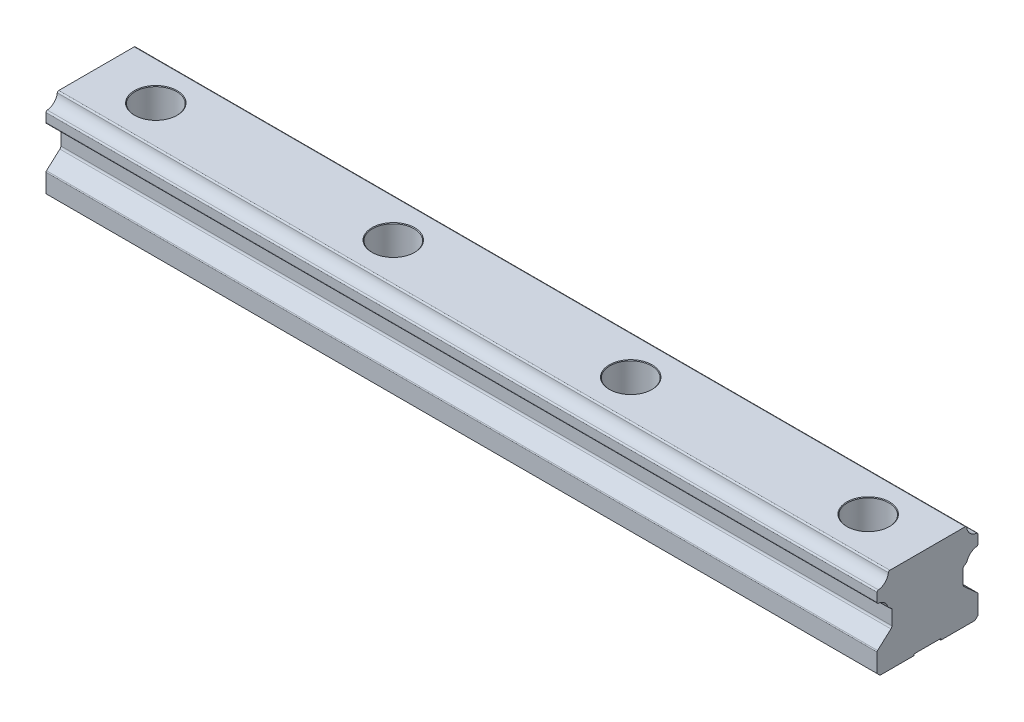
ISO-10303-21;
HEADER;
FILE_DESCRIPTION(('STEP AP214'),'2;1');
FILE_NAME('part.step','',(''),(''),'','','');
FILE_SCHEMA(('AUTOMOTIVE_DESIGN { 1 0 10303 214 1 1 1 1 }'));
ENDSEC;
DATA;
#1=APPLICATION_CONTEXT('core data for automotive mechanical design processes');
#2=APPLICATION_PROTOCOL_DEFINITION('international standard','automotive_design',2000,#1);
#3=PRODUCT_CONTEXT('',#1,'mechanical');
#4=PRODUCT('Part','Part','',(#3));
#5=PRODUCT_RELATED_PRODUCT_CATEGORY('part','',(#4));
#6=PRODUCT_DEFINITION_FORMATION('','',#4);
#7=PRODUCT_DEFINITION_CONTEXT('part definition',#1,'design');
#8=PRODUCT_DEFINITION('design','',#6,#7);
#9=PRODUCT_DEFINITION_SHAPE('','',#8);
#10=(LENGTH_UNIT() NAMED_UNIT(*) SI_UNIT(.MILLI.,.METRE.));
#11=(NAMED_UNIT(*) PLANE_ANGLE_UNIT() SI_UNIT($,.RADIAN.));
#12=(NAMED_UNIT(*) SI_UNIT($,.STERADIAN.) SOLID_ANGLE_UNIT());
#13=UNCERTAINTY_MEASURE_WITH_UNIT(LENGTH_MEASURE(1.E-05),#10,'distance_accuracy_value','');
#14=(GEOMETRIC_REPRESENTATION_CONTEXT(3) GLOBAL_UNCERTAINTY_ASSIGNED_CONTEXT((#13)) GLOBAL_UNIT_ASSIGNED_CONTEXT((#10,
#11,#12)) REPRESENTATION_CONTEXT('',''));
#15=CARTESIAN_POINT('',(0.,0.,0.));
#16=DIRECTION('',(0.,0.,1.));
#17=DIRECTION('',(1.,0.,0.));
#18=AXIS2_PLACEMENT_3D('',#15,#16,#17);
#19=CARTESIAN_POINT('',(280.,0.,-4.5));
#20=DIRECTION('',(0.,0.,1.));
#21=DIRECTION('',(1.,0.,0.));
#22=AXIS2_PLACEMENT_3D('',#19,#20,#21);
#23=PLANE('',#22);
#24=DIRECTION('',(-1.,0.,0.));
#25=VECTOR('',#24,1.);
#26=CARTESIAN_POINT('',(280.,0.5,-4.5));
#27=LINE('',#26,#25);
#28=CARTESIAN_POINT('',(19.7878090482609,0.5,-4.5));
#29=VERTEX_POINT('',#28);
#30=CARTESIAN_POINT('',(0.,0.5,-4.5));
#31=VERTEX_POINT('',#30);
#32=EDGE_CURVE('E11',#29,#31,#27,.T.);
#33=ORIENTED_EDGE('',*,*,#32,.T.);
#34=DIRECTION('',(0.,1.,0.));
#35=VECTOR('',#34,1.);
#36=CARTESIAN_POINT('',(0.,0.,-4.5));
#37=LINE('',#36,#35);
#38=CARTESIAN_POINT('',(0.,0.,-4.5));
#39=VERTEX_POINT('',#38);
#40=EDGE_CURVE('E42',#39,#31,#37,.T.);
#41=ORIENTED_EDGE('',*,*,#40,.F.);
#42=DIRECTION('',(-1.,0.,0.));
#43=VECTOR('',#42,1.);
#44=CARTESIAN_POINT('',(280.,0.,-4.5));
#45=LINE('',#44,#43);
#46=CARTESIAN_POINT('',(18.6263097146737,0.,-4.5));
#47=VERTEX_POINT('',#46);
#48=EDGE_CURVE('E621',#47,#39,#45,.T.);
#49=ORIENTED_EDGE('',*,*,#48,.F.);
#50=CARTESIAN_POINT('',(19.7878090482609,0.200000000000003,-4.5));
#51=CARTESIAN_POINT('',(19.739404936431,0.197723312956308,-4.49999868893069));
#52=CARTESIAN_POINT('',(19.6910370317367,0.194681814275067,-4.49998175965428));
#53=CARTESIAN_POINT('',(19.5944748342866,0.187084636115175,-4.49993533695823));
#54=CARTESIAN_POINT('',(19.5462804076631,0.182530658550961,-4.49990585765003));
#55=CARTESIAN_POINT('',(19.4499712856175,0.171909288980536,-4.49985287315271));
#56=CARTESIAN_POINT('',(19.4018568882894,0.165839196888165,-4.49982937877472));
#57=CARTESIAN_POINT('',(19.3056146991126,0.152190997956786,-4.49979757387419));
#58=CARTESIAN_POINT('',(19.2574878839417,0.144606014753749,-4.4997893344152));
#59=CARTESIAN_POINT('',(19.1611295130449,0.127931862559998,-4.49979083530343));
#60=CARTESIAN_POINT('',(19.1128998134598,0.118831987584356,-4.49980070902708));
#61=CARTESIAN_POINT('',(19.0162461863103,0.099131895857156,-4.49983447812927));
#62=CARTESIAN_POINT('',(18.9678251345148,0.0885175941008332,-4.49985851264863));
#63=CARTESIAN_POINT('',(18.870702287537,0.0657916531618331,-4.49991081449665));
#64=CARTESIAN_POINT('',(18.8220044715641,0.0536630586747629,-4.49993913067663));
#65=CARTESIAN_POINT('',(18.7242422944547,0.0279120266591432,-4.49998347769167));
#66=CARTESIAN_POINT('',(18.6751830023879,0.0142703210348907,-4.49999932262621));
#67=CARTESIAN_POINT('',(18.6263097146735,5.51994431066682E-13,-4.50000000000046));
#68=B_SPLINE_CURVE_WITH_KNOTS('',3,(#50,#51,#52,#53,#54,#55,#56,#57,#58,#59,#60,#61,#62,#63,#64,
#65,#66,#67),.UNSPECIFIED.,.F.,.F.,(4,2,2,2,2,2,2,2,4),(0.,0.145366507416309,0.290569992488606,
0.436033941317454,0.582173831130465,0.729394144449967,0.878085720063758,1.02862352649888,
1.18136490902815),.UNSPECIFIED.);
#69=CARTESIAN_POINT('',(19.7878090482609,0.2,-4.5));
#70=VERTEX_POINT('',#69);
#71=EDGE_CURVE('E951',#70,#47,#68,.T.);
#72=ORIENTED_EDGE('',*,*,#71,.F.);
#73=DIRECTION('',(0.,-1.,0.));
#74=VECTOR('',#73,1.);
#75=CARTESIAN_POINT('',(19.7878090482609,0.,-4.5));
#76=LINE('',#75,#74);
#77=EDGE_CURVE('E990',#29,#70,#76,.T.);
#78=ORIENTED_EDGE('',*,*,#77,.F.);
#79=EDGE_LOOP('',(#33,#41,#49,#72,#78));
#80=FACE_BOUND('',#79,.T.);
#81=ADVANCED_FACE('F17',(#80),#23,.T.);
#82=CARTESIAN_POINT('',(260.,0.2,0.));
#83=DIRECTION('',(0.,-1.,0.));
#84=DIRECTION('',(0.,0.,-1.));
#85=AXIS2_PLACEMENT_3D('',#82,#83,#84);
#86=CONICAL_SURFACE('',#85,4.505,0.7853981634);
#87=CARTESIAN_POINT('',(260.,0.,0.));
#88=DIRECTION('',(0.,-1.,0.));
#89=DIRECTION('',(0.,0.,-1.));
#90=AXIS2_PLACEMENT_3D('',#87,#88,#89);
#91=CIRCLE('',#90,4.705);
#92=CARTESIAN_POINT('',(261.373690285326,0.,4.5));
#93=VERTEX_POINT('',#92);
#94=CARTESIAN_POINT('',(258.626309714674,0.,4.5));
#95=VERTEX_POINT('',#94);
#96=EDGE_CURVE('E28',#93,#95,#91,.T.);
#97=ORIENTED_EDGE('',*,*,#96,.T.);
#98=CARTESIAN_POINT('',(258.626309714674,5.61996196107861E-13,4.50000000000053));
#99=CARTESIAN_POINT('',(258.675183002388,0.014270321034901,4.49999932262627));
#100=CARTESIAN_POINT('',(258.724242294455,0.0279120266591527,4.49998347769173));
#101=CARTESIAN_POINT('',(258.822004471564,0.0536630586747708,4.49993913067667));
#102=CARTESIAN_POINT('',(258.870702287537,0.0657916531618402,4.49991081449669));
#103=CARTESIAN_POINT('',(258.967825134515,0.0885175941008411,4.49985851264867));
#104=CARTESIAN_POINT('',(259.01624618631,0.0991318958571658,4.4998344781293));
#105=CARTESIAN_POINT('',(259.11289981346,0.118831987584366,4.4998007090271));
#106=CARTESIAN_POINT('',(259.161129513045,0.127931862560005,4.49979083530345));
#107=CARTESIAN_POINT('',(259.257487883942,0.144606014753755,4.49978933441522));
#108=CARTESIAN_POINT('',(259.305614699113,0.152190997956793,4.4997975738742));
#109=CARTESIAN_POINT('',(259.40185688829,0.165839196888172,4.49982937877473));
#110=CARTESIAN_POINT('',(259.449971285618,0.171909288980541,4.49985287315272));
#111=CARTESIAN_POINT('',(259.546280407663,0.182530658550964,4.49990585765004));
#112=CARTESIAN_POINT('',(259.594474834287,0.187084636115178,4.49993533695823));
#113=CARTESIAN_POINT('',(259.691037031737,0.194681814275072,4.49998175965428));
#114=CARTESIAN_POINT('',(259.739404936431,0.197723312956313,4.4999986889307));
#115=CARTESIAN_POINT('',(259.787809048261,0.200000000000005,4.50000000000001));
#116=B_SPLINE_CURVE_WITH_KNOTS('',3,(#98,#99,#100,#101,#102,#103,#104,#105,#106,#107,#108,#109,
#110,#111,#112,#113,#114,#115),.UNSPECIFIED.,.F.,.F.,(4,2,2,2,2,2,2,2,4),(0.,0.152741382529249,
0.303279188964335,0.451970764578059,0.59919107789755,0.74533096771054,0.890794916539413,
1.03599840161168,1.18136490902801),.UNSPECIFIED.);
#117=CARTESIAN_POINT('',(259.787809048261,0.2,4.5));
#118=VERTEX_POINT('',#117);
#119=EDGE_CURVE('E1093',#95,#118,#116,.T.);
#120=ORIENTED_EDGE('',*,*,#119,.T.);
#121=CARTESIAN_POINT('',(260.,0.2,0.));
#122=DIRECTION('',(0.,-1.,0.));
#123=DIRECTION('',(0.,0.,-1.));
#124=AXIS2_PLACEMENT_3D('',#121,#122,#123);
#125=CIRCLE('',#124,4.505);
#126=CARTESIAN_POINT('',(260.212190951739,0.2,4.5));
#127=VERTEX_POINT('',#126);
#128=EDGE_CURVE('E1704',#127,#118,#125,.T.);
#129=ORIENTED_EDGE('',*,*,#128,.F.);
#130=CARTESIAN_POINT('',(260.212190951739,0.200000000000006,4.50000000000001));
#131=CARTESIAN_POINT('',(260.260595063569,0.197723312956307,4.4999986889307));
#132=CARTESIAN_POINT('',(260.308962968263,0.194681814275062,4.49998175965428));
#133=CARTESIAN_POINT('',(260.405525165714,0.187084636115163,4.49993533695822));
#134=CARTESIAN_POINT('',(260.453719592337,0.182530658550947,4.49990585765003));
#135=CARTESIAN_POINT('',(260.550028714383,0.171909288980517,4.49985287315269));
#136=CARTESIAN_POINT('',(260.598143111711,0.165839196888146,4.49982937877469));
#137=CARTESIAN_POINT('',(260.694385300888,0.152190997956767,4.49979757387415));
#138=CARTESIAN_POINT('',(260.742512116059,0.144606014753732,4.49978933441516));
#139=CARTESIAN_POINT('',(260.838870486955,0.127931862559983,4.49979083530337));
#140=CARTESIAN_POINT('',(260.88710018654,0.118831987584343,4.49980070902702));
#141=CARTESIAN_POINT('',(260.98375381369,0.0991318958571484,4.49983447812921));
#142=CARTESIAN_POINT('',(261.032174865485,0.0885175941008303,4.49985851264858));
#143=CARTESIAN_POINT('',(261.129297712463,0.065791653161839,4.49991081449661));
#144=CARTESIAN_POINT('',(261.177995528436,0.0536630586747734,4.4999391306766));
#145=CARTESIAN_POINT('',(261.275757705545,0.0279120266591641,4.49998347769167));
#146=CARTESIAN_POINT('',(261.324816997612,0.0142703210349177,4.49999932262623));
#147=CARTESIAN_POINT('',(261.373690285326,5.86499165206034E-13,4.50000000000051));
#148=B_SPLINE_CURVE_WITH_KNOTS('',3,(#130,#131,#132,#133,#134,#135,#136,#137,#138,#139,#140,
#141,#142,#143,#144,#145,#146,#147),.UNSPECIFIED.,.F.,.F.,(4,2,2,2,2,2,2,2,4),(0.,
0.145366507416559,0.290569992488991,0.436033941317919,0.582173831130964,0.7293941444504,
0.878085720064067,1.02862352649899,1.18136490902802),.UNSPECIFIED.);
#149=EDGE_CURVE('E1132',#127,#93,#148,.T.);
#150=ORIENTED_EDGE('',*,*,#149,.T.);
#151=EDGE_LOOP('',(#97,#120,#129,#150));
#152=FACE_BOUND('',#151,.T.);
#153=ADVANCED_FACE('F1100',(#152),#86,.F.);
#154=CARTESIAN_POINT('',(100.,0.2,0.));
#155=DIRECTION('',(0.,-1.,0.));
#156=DIRECTION('',(0.,0.,-1.));
#157=AXIS2_PLACEMENT_3D('',#154,#155,#156);
#158=CONICAL_SURFACE('',#157,4.505,0.7853981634);
#159=CARTESIAN_POINT('',(100.,0.,0.));
#160=DIRECTION('',(0.,-1.,0.));
#161=DIRECTION('',(0.,0.,-1.));
#162=AXIS2_PLACEMENT_3D('',#159,#160,#161);
#163=CIRCLE('',#162,4.705);
#164=CARTESIAN_POINT('',(101.373690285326,0.,4.5));
#165=VERTEX_POINT('',#164);
#166=CARTESIAN_POINT('',(98.6263097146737,0.,4.5));
#167=VERTEX_POINT('',#166);
#168=EDGE_CURVE('E1976',#165,#167,#163,.T.);
#169=ORIENTED_EDGE('',*,*,#168,.T.);
#170=CARTESIAN_POINT('',(98.6263097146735,5.24997796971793E-13,4.50000000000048));
#171=CARTESIAN_POINT('',(98.675183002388,0.0142703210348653,4.49999932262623));
#172=CARTESIAN_POINT('',(98.7242422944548,0.0279120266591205,4.4999834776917));
#173=CARTESIAN_POINT('',(98.8220044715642,0.0536630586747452,4.49993913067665));
#174=CARTESIAN_POINT('',(98.8707022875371,0.0657916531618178,4.49991081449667));
#175=CARTESIAN_POINT('',(98.9678251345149,0.0885175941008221,4.49985851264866));
#176=CARTESIAN_POINT('',(99.0162461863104,0.0991318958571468,4.49983447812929));
#177=CARTESIAN_POINT('',(99.1128998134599,0.118831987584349,4.4998007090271));
#178=CARTESIAN_POINT('',(99.161129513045,0.127931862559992,4.49979083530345));
#179=CARTESIAN_POINT('',(99.2574878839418,0.144606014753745,4.49978933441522));
#180=CARTESIAN_POINT('',(99.3056146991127,0.152190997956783,4.4997975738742));
#181=CARTESIAN_POINT('',(99.4018568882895,0.165839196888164,4.49982937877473));
#182=CARTESIAN_POINT('',(99.4499712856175,0.171909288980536,4.49985287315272));
#183=CARTESIAN_POINT('',(99.5462804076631,0.182530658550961,4.49990585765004));
#184=CARTESIAN_POINT('',(99.5944748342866,0.187084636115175,4.49993533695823));
#185=CARTESIAN_POINT('',(99.6910370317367,0.194681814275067,4.49998175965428));
#186=CARTESIAN_POINT('',(99.739404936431,0.197723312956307,4.49999868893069));
#187=CARTESIAN_POINT('',(99.7878090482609,0.200000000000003,4.5));
#188=B_SPLINE_CURVE_WITH_KNOTS('',3,(#170,#171,#172,#173,#174,#175,#176,#177,#178,#179,#180,
#181,#182,#183,#184,#185,#186,#187),.UNSPECIFIED.,.F.,.F.,(4,2,2,2,2,2,2,2,4),(0.,
0.152741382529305,0.303279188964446,0.451970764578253,0.599191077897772,0.745330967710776,
0.890794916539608,1.03599840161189,1.18136490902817),.UNSPECIFIED.);
#189=CARTESIAN_POINT('',(99.7878090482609,0.2,4.5));
#190=VERTEX_POINT('',#189);
#191=EDGE_CURVE('E1978',#167,#190,#188,.T.);
#192=ORIENTED_EDGE('',*,*,#191,.T.);
#193=CARTESIAN_POINT('',(100.,0.2,0.));
#194=DIRECTION('',(0.,-1.,0.));
#195=DIRECTION('',(0.,0.,-1.));
#196=AXIS2_PLACEMENT_3D('',#193,#194,#195);
#197=CIRCLE('',#196,4.505);
#198=CARTESIAN_POINT('',(100.212190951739,0.2,4.5));
#199=VERTEX_POINT('',#198);
#200=EDGE_CURVE('E1369',#199,#190,#197,.T.);
#201=ORIENTED_EDGE('',*,*,#200,.F.);
#202=CARTESIAN_POINT('',(100.212190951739,0.200000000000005,4.50000000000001));
#203=CARTESIAN_POINT('',(100.260595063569,0.197723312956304,4.4999986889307));
#204=CARTESIAN_POINT('',(100.308962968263,0.19468181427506,4.49998175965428));
#205=CARTESIAN_POINT('',(100.405525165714,0.187084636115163,4.49993533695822));
#206=CARTESIAN_POINT('',(100.453719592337,0.182530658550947,4.49990585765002));
#207=CARTESIAN_POINT('',(100.550028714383,0.171909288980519,4.49985287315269));
#208=CARTESIAN_POINT('',(100.598143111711,0.165839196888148,4.49982937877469));
#209=CARTESIAN_POINT('',(100.694385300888,0.152190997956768,4.49979757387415));
#210=CARTESIAN_POINT('',(100.742512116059,0.144606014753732,4.49978933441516));
#211=CARTESIAN_POINT('',(100.838870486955,0.127931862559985,4.49979083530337));
#212=CARTESIAN_POINT('',(100.887100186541,0.118831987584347,4.49980070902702));
#213=CARTESIAN_POINT('',(100.98375381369,0.0991318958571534,4.49983447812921));
#214=CARTESIAN_POINT('',(101.032174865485,0.0885175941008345,4.49985851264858));
#215=CARTESIAN_POINT('',(101.129297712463,0.0657916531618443,4.4999108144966));
#216=CARTESIAN_POINT('',(101.177995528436,0.0536630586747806,4.49993913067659));
#217=CARTESIAN_POINT('',(101.275757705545,0.0279120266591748,4.49998347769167));
#218=CARTESIAN_POINT('',(101.324816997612,0.0142703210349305,4.49999932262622));
#219=CARTESIAN_POINT('',(101.373690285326,5.96013039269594E-13,4.5000000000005));
#220=B_SPLINE_CURVE_WITH_KNOTS('',3,(#202,#203,#204,#205,#206,#207,#208,#209,#210,#211,#212,
#213,#214,#215,#216,#217,#218,#219),.UNSPECIFIED.,.F.,.F.,(4,2,2,2,2,2,2,2,4),(0.,
0.145366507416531,0.290569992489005,0.436033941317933,0.58217383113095,0.729394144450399,
0.878085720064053,1.02862352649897,1.18136490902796),.UNSPECIFIED.);
#221=EDGE_CURVE('E1847',#199,#165,#220,.T.);
#222=ORIENTED_EDGE('',*,*,#221,.T.);
#223=EDGE_LOOP('',(#169,#192,#201,#222));
#224=FACE_BOUND('',#223,.T.);
#225=ADVANCED_FACE('F1110',(#224),#158,.F.);
#226=CARTESIAN_POINT('',(20.,0.2,0.));
#227=DIRECTION('',(0.,-1.,0.));
#228=DIRECTION('',(0.,0.,-1.));
#229=AXIS2_PLACEMENT_3D('',#226,#227,#228);
#230=CONICAL_SURFACE('',#229,4.505,0.7853981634);
#231=CARTESIAN_POINT('',(20.,0.,0.));
#232=DIRECTION('',(0.,-1.,0.));
#233=DIRECTION('',(0.,0.,-1.));
#234=AXIS2_PLACEMENT_3D('',#231,#232,#233);
#235=CIRCLE('',#234,4.705);
#236=CARTESIAN_POINT('',(21.3736902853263,0.,4.5));
#237=VERTEX_POINT('',#236);
#238=CARTESIAN_POINT('',(18.6263097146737,0.,4.5));
#239=VERTEX_POINT('',#238);
#240=EDGE_CURVE('E1806',#237,#239,#235,.T.);
#241=ORIENTED_EDGE('',*,*,#240,.T.);
#242=CARTESIAN_POINT('',(18.6263097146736,5.26515680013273E-13,4.50000000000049));
#243=CARTESIAN_POINT('',(18.675183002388,0.0142703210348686,4.49999932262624));
#244=CARTESIAN_POINT('',(18.7242422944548,0.0279120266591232,4.49998347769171));
#245=CARTESIAN_POINT('',(18.8220044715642,0.0536630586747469,4.49993913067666));
#246=CARTESIAN_POINT('',(18.8707022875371,0.0657916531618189,4.49991081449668));
#247=CARTESIAN_POINT('',(18.9678251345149,0.0885175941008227,4.49985851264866));
#248=CARTESIAN_POINT('',(19.0162461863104,0.0991318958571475,4.49983447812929));
#249=CARTESIAN_POINT('',(19.1128998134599,0.118831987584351,4.4998007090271));
#250=CARTESIAN_POINT('',(19.161129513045,0.127931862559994,4.49979083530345));
#251=CARTESIAN_POINT('',(19.2574878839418,0.144606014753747,4.49978933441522));
#252=CARTESIAN_POINT('',(19.3056146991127,0.152190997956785,4.4997975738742));
#253=CARTESIAN_POINT('',(19.4018568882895,0.165839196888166,4.49982937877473));
#254=CARTESIAN_POINT('',(19.4499712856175,0.171909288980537,4.49985287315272));
#255=CARTESIAN_POINT('',(19.5462804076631,0.182530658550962,4.49990585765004));
#256=CARTESIAN_POINT('',(19.5944748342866,0.187084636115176,4.49993533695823));
#257=CARTESIAN_POINT('',(19.6910370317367,0.194681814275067,4.49998175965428));
#258=CARTESIAN_POINT('',(19.739404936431,0.197723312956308,4.49999868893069));
#259=CARTESIAN_POINT('',(19.7878090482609,0.200000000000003,4.5));
#260=B_SPLINE_CURVE_WITH_KNOTS('',3,(#242,#243,#244,#245,#246,#247,#248,#249,#250,#251,#252,
#253,#254,#255,#256,#257,#258,#259),.UNSPECIFIED.,.F.,.F.,(4,2,2,2,2,2,2,2,4),(0.,
0.152741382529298,0.30327918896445,0.451970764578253,0.599191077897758,0.745330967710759,
0.890794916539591,1.03599840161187,1.18136490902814),.UNSPECIFIED.);
#261=CARTESIAN_POINT('',(19.7878090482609,0.2,4.5));
#262=VERTEX_POINT('',#261);
#263=EDGE_CURVE('E603',#239,#262,#260,.T.);
#264=ORIENTED_EDGE('',*,*,#263,.T.);
#265=CARTESIAN_POINT('',(20.,0.2,0.));
#266=DIRECTION('',(0.,-1.,0.));
#267=DIRECTION('',(0.,0.,-1.));
#268=AXIS2_PLACEMENT_3D('',#265,#266,#267);
#269=CIRCLE('',#268,4.505);
#270=CARTESIAN_POINT('',(20.2121909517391,0.2,4.5));
#271=VERTEX_POINT('',#270);
#272=EDGE_CURVE('E1820',#271,#262,#269,.T.);
#273=ORIENTED_EDGE('',*,*,#272,.F.);
#274=CARTESIAN_POINT('',(20.2121909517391,0.200000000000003,4.5));
#275=CARTESIAN_POINT('',(20.260595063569,0.197723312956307,4.49999868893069));
#276=CARTESIAN_POINT('',(20.3089629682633,0.194681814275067,4.49998175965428));
#277=CARTESIAN_POINT('',(20.4055251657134,0.187084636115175,4.49993533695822));
#278=CARTESIAN_POINT('',(20.453719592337,0.182530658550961,4.49990585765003));
#279=CARTESIAN_POINT('',(20.5500287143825,0.171909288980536,4.49985287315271));
#280=CARTESIAN_POINT('',(20.5981431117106,0.165839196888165,4.49982937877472));
#281=CARTESIAN_POINT('',(20.6943853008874,0.152190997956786,4.49979757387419));
#282=CARTESIAN_POINT('',(20.7425121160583,0.144606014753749,4.4997893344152));
#283=CARTESIAN_POINT('',(20.8388704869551,0.127931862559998,4.49979083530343));
#284=CARTESIAN_POINT('',(20.8871001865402,0.118831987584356,4.49980070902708));
#285=CARTESIAN_POINT('',(20.9837538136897,0.0991318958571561,4.49983447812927));
#286=CARTESIAN_POINT('',(21.0321748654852,0.0885175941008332,4.49985851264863));
#287=CARTESIAN_POINT('',(21.129297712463,0.0657916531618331,4.49991081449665));
#288=CARTESIAN_POINT('',(21.1779955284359,0.053663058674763,4.49993913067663));
#289=CARTESIAN_POINT('',(21.2757577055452,0.0279120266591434,4.49998347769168));
#290=CARTESIAN_POINT('',(21.3248169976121,0.014270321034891,4.49999932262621));
#291=CARTESIAN_POINT('',(21.3736902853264,5.51994431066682E-13,4.50000000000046));
#292=B_SPLINE_CURVE_WITH_KNOTS('',3,(#274,#275,#276,#277,#278,#279,#280,#281,#282,#283,#284,
#285,#286,#287,#288,#289,#290,#291),.UNSPECIFIED.,.F.,.F.,(4,2,2,2,2,2,2,2,4),(0.,
0.145366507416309,0.290569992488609,0.436033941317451,0.582173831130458,0.72939414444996,
0.878085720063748,1.02862352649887,1.18136490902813),.UNSPECIFIED.);
#293=EDGE_CURVE('E1053',#271,#237,#292,.T.);
#294=ORIENTED_EDGE('',*,*,#293,.T.);
#295=EDGE_LOOP('',(#241,#264,#273,#294));
#296=FACE_BOUND('',#295,.T.);
#297=ADVANCED_FACE('F1870',(#296),#230,.F.);
#298=CARTESIAN_POINT('',(20.,0.,0.));
#299=DIRECTION('',(0.,1.,0.));
#300=DIRECTION('',(0.,0.,-1.));
#301=AXIS2_PLACEMENT_3D('',#298,#299,#300);
#302=CYLINDRICAL_SURFACE('',#301,4.505);
#303=CARTESIAN_POINT('',(20.,17.,0.));
#304=DIRECTION('',(0.,-1.,0.));
#305=DIRECTION('',(0.,0.,-1.));
#306=AXIS2_PLACEMENT_3D('',#303,#304,#305);
#307=CIRCLE('',#306,4.505);
#308=CARTESIAN_POINT('',(20.,17.,-4.505));
#309=VERTEX_POINT('',#308);
#310=EDGE_CURVE('E998',#309,#309,#307,.T.);
#311=ORIENTED_EDGE('',*,*,#310,.F.);
#312=EDGE_LOOP('',(#311));
#313=FACE_BOUND('',#312,.T.);
#314=CARTESIAN_POINT('',(20.,0.5,0.));
#315=DIRECTION('',(0.,-1.,0.));
#316=DIRECTION('',(0.,0.,-1.));
#317=AXIS2_PLACEMENT_3D('',#314,#315,#316);
#318=CIRCLE('',#317,4.505);
#319=CARTESIAN_POINT('',(20.2121909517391,0.5,-4.5));
#320=VERTEX_POINT('',#319);
#321=CARTESIAN_POINT('',(20.2121909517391,0.5,4.5));
#322=VERTEX_POINT('',#321);
#323=EDGE_CURVE('E1049',#320,#322,#318,.T.);
#324=ORIENTED_EDGE('',*,*,#323,.T.);
#325=DIRECTION('',(0.,-1.,0.));
#326=VECTOR('',#325,1.);
#327=CARTESIAN_POINT('',(20.2121909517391,0.,4.5));
#328=LINE('',#327,#326);
#329=EDGE_CURVE('E1054',#322,#271,#328,.T.);
#330=ORIENTED_EDGE('',*,*,#329,.T.);
#331=ORIENTED_EDGE('',*,*,#272,.T.);
#332=DIRECTION('',(0.,1.,0.));
#333=VECTOR('',#332,1.);
#334=CARTESIAN_POINT('',(19.7878090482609,0.,4.5));
#335=LINE('',#334,#333);
#336=CARTESIAN_POINT('',(19.7878090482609,0.5,4.5));
#337=VERTEX_POINT('',#336);
#338=EDGE_CURVE('E989',#262,#337,#335,.T.);
#339=ORIENTED_EDGE('',*,*,#338,.T.);
#340=CARTESIAN_POINT('',(20.,0.5,0.));
#341=DIRECTION('',(0.,-1.,0.));
#342=DIRECTION('',(0.,0.,-1.));
#343=AXIS2_PLACEMENT_3D('',#340,#341,#342);
#344=CIRCLE('',#343,4.505);
#345=EDGE_CURVE('E985',#337,#29,#344,.T.);
#346=ORIENTED_EDGE('',*,*,#345,.T.);
#347=ORIENTED_EDGE('',*,*,#77,.T.);
#348=CARTESIAN_POINT('',(20.,0.2,0.));
#349=DIRECTION('',(0.,-1.,0.));
#350=DIRECTION('',(0.,0.,-1.));
#351=AXIS2_PLACEMENT_3D('',#348,#349,#350);
#352=CIRCLE('',#351,4.505);
#353=CARTESIAN_POINT('',(20.2121909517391,0.2,-4.5));
#354=VERTEX_POINT('',#353);
#355=EDGE_CURVE('E1251',#70,#354,#352,.T.);
#356=ORIENTED_EDGE('',*,*,#355,.T.);
#357=DIRECTION('',(0.,1.,0.));
#358=VECTOR('',#357,1.);
#359=CARTESIAN_POINT('',(20.2121909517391,0.,-4.5));
#360=LINE('',#359,#358);
#361=EDGE_CURVE('E1066',#354,#320,#360,.T.);
#362=ORIENTED_EDGE('',*,*,#361,.T.);
#363=EDGE_LOOP('',(#324,#330,#331,#339,#346,#347,#356,#362));
#364=FACE_BOUND('',#363,.T.);
#365=ADVANCED_FACE('F1188',(#313,#364),#302,.F.);
#366=CARTESIAN_POINT('',(27.005,17.,0.));
#367=DIRECTION('',(0.,1.,0.));
#368=DIRECTION('',(1.,0.,0.));
#369=AXIS2_PLACEMENT_3D('',#366,#367,#368);
#370=PLANE('',#369);
#371=CARTESIAN_POINT('',(20.,17.,0.));
#372=DIRECTION('',(0.,-1.,0.));
#373=DIRECTION('',(0.,0.,-1.));
#374=AXIS2_PLACEMENT_3D('',#371,#372,#373);
#375=CIRCLE('',#374,7.005);
#376=CARTESIAN_POINT('',(20.,17.,-7.005));
#377=VERTEX_POINT('',#376);
#378=EDGE_CURVE('E994',#377,#377,#375,.T.);
#379=ORIENTED_EDGE('',*,*,#378,.F.);
#380=EDGE_LOOP('',(#379));
#381=FACE_BOUND('',#380,.T.);
#382=ORIENTED_EDGE('',*,*,#310,.T.);
#383=EDGE_LOOP('',(#382));
#384=FACE_BOUND('',#383,.T.);
#385=ADVANCED_FACE('F2064',(#381,#384),#370,.T.);
#386=CARTESIAN_POINT('',(20.,0.,0.));
#387=DIRECTION('',(0.,1.,0.));
#388=DIRECTION('',(0.,0.,-1.));
#389=AXIS2_PLACEMENT_3D('',#386,#387,#388);
#390=CYLINDRICAL_SURFACE('',#389,7.005);
#391=CARTESIAN_POINT('',(20.,28.8,0.));
#392=DIRECTION('',(0.,-1.,0.));
#393=DIRECTION('',(0.,0.,-1.));
#394=AXIS2_PLACEMENT_3D('',#391,#392,#393);
#395=CIRCLE('',#394,7.005);
#396=CARTESIAN_POINT('',(20.,28.8,-7.005));
#397=VERTEX_POINT('',#396);
#398=EDGE_CURVE('E779',#397,#397,#395,.T.);
#399=ORIENTED_EDGE('',*,*,#398,.F.);
#400=EDGE_LOOP('',(#399));
#401=FACE_BOUND('',#400,.T.);
#402=ORIENTED_EDGE('',*,*,#378,.T.);
#403=EDGE_LOOP('',(#402));
#404=FACE_BOUND('',#403,.T.);
#405=ADVANCED_FACE('F1543',(#401,#404),#390,.F.);
#406=CARTESIAN_POINT('',(20.,29.,0.));
#407=DIRECTION('',(0.,1.,0.));
#408=DIRECTION('',(0.,0.,1.));
#409=AXIS2_PLACEMENT_3D('',#406,#407,#408);
#410=CONICAL_SURFACE('',#409,7.205,0.7853981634);
#411=CARTESIAN_POINT('',(20.,29.,0.));
#412=DIRECTION('',(0.,-1.,0.));
#413=DIRECTION('',(0.,0.,-1.));
#414=AXIS2_PLACEMENT_3D('',#411,#412,#413);
#415=CIRCLE('',#414,7.205);
#416=CARTESIAN_POINT('',(20.,29.,-7.205));
#417=VERTEX_POINT('',#416);
#418=EDGE_CURVE('E887',#417,#417,#415,.T.);
#419=ORIENTED_EDGE('',*,*,#418,.F.);
#420=EDGE_LOOP('',(#419));
#421=FACE_BOUND('',#420,.T.);
#422=ORIENTED_EDGE('',*,*,#398,.T.);
#423=EDGE_LOOP('',(#422));
#424=FACE_BOUND('',#423,.T.);
#425=ADVANCED_FACE('F2345',(#421,#424),#410,.F.);
#426=CARTESIAN_POINT('',(187.005,17.,0.));
#427=DIRECTION('',(0.,1.,0.));
#428=DIRECTION('',(1.,0.,0.));
#429=AXIS2_PLACEMENT_3D('',#426,#427,#428);
#430=PLANE('',#429);
#431=CARTESIAN_POINT('',(180.,17.,0.));
#432=DIRECTION('',(0.,-1.,0.));
#433=DIRECTION('',(0.,0.,-1.));
#434=AXIS2_PLACEMENT_3D('',#431,#432,#433);
#435=CIRCLE('',#434,7.005);
#436=CARTESIAN_POINT('',(180.,17.,-7.005));
#437=VERTEX_POINT('',#436);
#438=EDGE_CURVE('E610',#437,#437,#435,.T.);
#439=ORIENTED_EDGE('',*,*,#438,.F.);
#440=EDGE_LOOP('',(#439));
#441=FACE_BOUND('',#440,.T.);
#442=CARTESIAN_POINT('',(180.,17.,0.));
#443=DIRECTION('',(0.,-1.,0.));
#444=DIRECTION('',(0.,0.,-1.));
#445=AXIS2_PLACEMENT_3D('',#442,#443,#444);
#446=CIRCLE('',#445,4.505);
#447=CARTESIAN_POINT('',(180.,17.,-4.505));
#448=VERTEX_POINT('',#447);
#449=EDGE_CURVE('E697',#448,#448,#446,.T.);
#450=ORIENTED_EDGE('',*,*,#449,.T.);
#451=EDGE_LOOP('',(#450));
#452=FACE_BOUND('',#451,.T.);
#453=ADVANCED_FACE('F1654',(#441,#452),#430,.T.);
#454=CARTESIAN_POINT('',(280.,0.,16.));
#455=DIRECTION('',(0.,1.,0.));
#456=DIRECTION('',(1.,0.,0.));
#457=AXIS2_PLACEMENT_3D('',#454,#455,#456);
#458=PLANE('',#457);
#459=DIRECTION('',(-1.,0.,0.));
#460=VECTOR('',#459,1.);
#461=CARTESIAN_POINT('',(280.,0.,4.5));
#462=LINE('',#461,#460);
#463=CARTESIAN_POINT('',(280.,0.,4.5));
#464=VERTEX_POINT('',#463);
#465=EDGE_CURVE('E813',#464,#93,#462,.T.);
#466=ORIENTED_EDGE('',*,*,#465,.F.);
#467=DIRECTION('',(0.,0.,-1.));
#468=VECTOR('',#467,1.);
#469=CARTESIAN_POINT('',(280.,0.,16.));
#470=LINE('',#469,#468);
#471=CARTESIAN_POINT('',(280.,0.,16.));
#472=VERTEX_POINT('',#471);
#473=EDGE_CURVE('E644',#472,#464,#470,.T.);
#474=ORIENTED_EDGE('',*,*,#473,.F.);
#475=DIRECTION('',(-1.,0.,0.));
#476=VECTOR('',#475,1.);
#477=CARTESIAN_POINT('',(280.,0.,16.));
#478=LINE('',#477,#476);
#479=CARTESIAN_POINT('',(0.,0.,16.));
#480=VERTEX_POINT('',#479);
#481=EDGE_CURVE('E617',#472,#480,#478,.T.);
#482=ORIENTED_EDGE('',*,*,#481,.T.);
#483=DIRECTION('',(0.,0.,-1.));
#484=VECTOR('',#483,1.);
#485=CARTESIAN_POINT('',(0.,0.,16.));
#486=LINE('',#485,#484);
#487=CARTESIAN_POINT('',(0.,0.,4.5));
#488=VERTEX_POINT('',#487);
#489=EDGE_CURVE('E613',#480,#488,#486,.T.);
#490=ORIENTED_EDGE('',*,*,#489,.T.);
#491=DIRECTION('',(-1.,0.,0.));
#492=VECTOR('',#491,1.);
#493=CARTESIAN_POINT('',(280.,0.,4.5));
#494=LINE('',#493,#492);
#495=EDGE_CURVE('E594',#239,#488,#494,.T.);
#496=ORIENTED_EDGE('',*,*,#495,.F.);
#497=ORIENTED_EDGE('',*,*,#240,.F.);
#498=DIRECTION('',(-1.,0.,0.));
#499=VECTOR('',#498,1.);
#500=CARTESIAN_POINT('',(280.,0.,4.5));
#501=LINE('',#500,#499);
#502=EDGE_CURVE('E877',#167,#237,#501,.T.);
#503=ORIENTED_EDGE('',*,*,#502,.F.);
#504=ORIENTED_EDGE('',*,*,#168,.F.);
#505=DIRECTION('',(-1.,0.,0.));
#506=VECTOR('',#505,1.);
#507=CARTESIAN_POINT('',(280.,0.,4.5));
#508=LINE('',#507,#506);
#509=CARTESIAN_POINT('',(178.626309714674,0.,4.5));
#510=VERTEX_POINT('',#509);
#511=EDGE_CURVE('E862',#510,#165,#508,.T.);
#512=ORIENTED_EDGE('',*,*,#511,.F.);
#513=CARTESIAN_POINT('',(180.,0.,0.));
#514=DIRECTION('',(0.,-1.,0.));
#515=DIRECTION('',(0.,0.,-1.));
#516=AXIS2_PLACEMENT_3D('',#513,#514,#515);
#517=CIRCLE('',#516,4.705);
#518=CARTESIAN_POINT('',(181.373690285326,0.,4.5));
#519=VERTEX_POINT('',#518);
#520=EDGE_CURVE('E586',#519,#510,#517,.T.);
#521=ORIENTED_EDGE('',*,*,#520,.F.);
#522=DIRECTION('',(-1.,0.,0.));
#523=VECTOR('',#522,1.);
#524=CARTESIAN_POINT('',(280.,0.,4.5));
#525=LINE('',#524,#523);
#526=EDGE_CURVE('E689',#95,#519,#525,.T.);
#527=ORIENTED_EDGE('',*,*,#526,.F.);
#528=ORIENTED_EDGE('',*,*,#96,.F.);
#529=EDGE_LOOP('',(#466,#474,#482,#490,#496,#497,#503,#504,#512,#521,#527,#528));
#530=FACE_BOUND('',#529,.T.);
#531=ADVANCED_FACE('F615',(#530),#458,.F.);
#532=CARTESIAN_POINT('',(280.,0.,16.));
#533=DIRECTION('',(0.,1.,0.));
#534=DIRECTION('',(1.,0.,0.));
#535=AXIS2_PLACEMENT_3D('',#532,#533,#534);
#536=PLANE('',#535);
#537=ORIENTED_EDGE('',*,*,#48,.T.);
#538=DIRECTION('',(0.,0.,-1.));
#539=VECTOR('',#538,1.);
#540=CARTESIAN_POINT('',(0.,0.,16.));
#541=LINE('',#540,#539);
#542=CARTESIAN_POINT('',(0.,0.,-16.));
#543=VERTEX_POINT('',#542);
#544=EDGE_CURVE('E878',#39,#543,#541,.T.);
#545=ORIENTED_EDGE('',*,*,#544,.T.);
#546=DIRECTION('',(-1.,0.,0.));
#547=VECTOR('',#546,1.);
#548=CARTESIAN_POINT('',(280.,0.,-16.));
#549=LINE('',#548,#547);
#550=CARTESIAN_POINT('',(280.,0.,-16.));
#551=VERTEX_POINT('',#550);
#552=EDGE_CURVE('E837',#551,#543,#549,.T.);
#553=ORIENTED_EDGE('',*,*,#552,.F.);
#554=DIRECTION('',(0.,0.,-1.));
#555=VECTOR('',#554,1.);
#556=CARTESIAN_POINT('',(280.,0.,16.));
#557=LINE('',#556,#555);
#558=CARTESIAN_POINT('',(280.,0.,-4.5));
#559=VERTEX_POINT('',#558);
#560=EDGE_CURVE('E647',#559,#551,#557,.T.);
#561=ORIENTED_EDGE('',*,*,#560,.F.);
#562=DIRECTION('',(-1.,0.,0.));
#563=VECTOR('',#562,1.);
#564=CARTESIAN_POINT('',(280.,0.,-4.5));
#565=LINE('',#564,#563);
#566=CARTESIAN_POINT('',(261.373690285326,0.,-4.5));
#567=VERTEX_POINT('',#566);
#568=EDGE_CURVE('E882',#559,#567,#565,.T.);
#569=ORIENTED_EDGE('',*,*,#568,.T.);
#570=CARTESIAN_POINT('',(260.,0.,0.));
#571=DIRECTION('',(0.,-1.,0.));
#572=DIRECTION('',(0.,0.,-1.));
#573=AXIS2_PLACEMENT_3D('',#570,#571,#572);
#574=CIRCLE('',#573,4.705);
#575=CARTESIAN_POINT('',(258.626309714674,0.,-4.5));
#576=VERTEX_POINT('',#575);
#577=EDGE_CURVE('E1732',#576,#567,#574,.T.);
#578=ORIENTED_EDGE('',*,*,#577,.F.);
#579=DIRECTION('',(-1.,0.,0.));
#580=VECTOR('',#579,1.);
#581=CARTESIAN_POINT('',(280.,0.,-4.5));
#582=LINE('',#581,#580);
#583=CARTESIAN_POINT('',(181.373690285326,0.,-4.5));
#584=VERTEX_POINT('',#583);
#585=EDGE_CURVE('E1341',#576,#584,#582,.T.);
#586=ORIENTED_EDGE('',*,*,#585,.T.);
#587=CARTESIAN_POINT('',(180.,0.,0.));
#588=DIRECTION('',(0.,-1.,0.));
#589=DIRECTION('',(0.,0.,-1.));
#590=AXIS2_PLACEMENT_3D('',#587,#588,#589);
#591=CIRCLE('',#590,4.705);
#592=CARTESIAN_POINT('',(178.626309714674,0.,-4.5));
#593=VERTEX_POINT('',#592);
#594=EDGE_CURVE('E1588',#593,#584,#591,.T.);
#595=ORIENTED_EDGE('',*,*,#594,.F.);
#596=DIRECTION('',(-1.,0.,0.));
#597=VECTOR('',#596,1.);
#598=CARTESIAN_POINT('',(280.,0.,-4.5));
#599=LINE('',#598,#597);
#600=CARTESIAN_POINT('',(101.373690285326,0.,-4.5));
#601=VERTEX_POINT('',#600);
#602=EDGE_CURVE('E1337',#593,#601,#599,.T.);
#603=ORIENTED_EDGE('',*,*,#602,.T.);
#604=CARTESIAN_POINT('',(100.,0.,0.));
#605=DIRECTION('',(0.,-1.,0.));
#606=DIRECTION('',(0.,0.,-1.));
#607=AXIS2_PLACEMENT_3D('',#604,#605,#606);
#608=CIRCLE('',#607,4.705);
#609=CARTESIAN_POINT('',(98.6263097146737,0.,-4.5));
#610=VERTEX_POINT('',#609);
#611=EDGE_CURVE('E1325',#610,#601,#608,.T.);
#612=ORIENTED_EDGE('',*,*,#611,.F.);
#613=DIRECTION('',(-1.,0.,0.));
#614=VECTOR('',#613,1.);
#615=CARTESIAN_POINT('',(280.,0.,-4.5));
#616=LINE('',#615,#614);
#617=CARTESIAN_POINT('',(21.3736902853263,0.,-4.5));
#618=VERTEX_POINT('',#617);
#619=EDGE_CURVE('E893',#610,#618,#616,.T.);
#620=ORIENTED_EDGE('',*,*,#619,.T.);
#621=CARTESIAN_POINT('',(20.,0.,0.));
#622=DIRECTION('',(0.,-1.,0.));
#623=DIRECTION('',(0.,0.,-1.));
#624=AXIS2_PLACEMENT_3D('',#621,#622,#623);
#625=CIRCLE('',#624,4.705);
#626=EDGE_CURVE('E1237',#47,#618,#625,.T.);
#627=ORIENTED_EDGE('',*,*,#626,.F.);
#628=EDGE_LOOP('',(#537,#545,#553,#561,#569,#578,#586,#595,#603,#612,#620,#627));
#629=FACE_BOUND('',#628,.T.);
#630=ADVANCED_FACE('F1519',(#629),#536,.F.);
#631=CARTESIAN_POINT('',(280.,1.,17.));
#632=DIRECTION('',(0.,0.707106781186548,-0.707106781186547));
#633=DIRECTION('',(-1.,0.,0.));
#634=AXIS2_PLACEMENT_3D('',#631,#632,#633);
#635=PLANE('',#634);
#636=DIRECTION('',(0.,-0.707106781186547,-0.707106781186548));
#637=VECTOR('',#636,1.);
#638=CARTESIAN_POINT('',(0.,1.,17.));
#639=LINE('',#638,#637);
#640=CARTESIAN_POINT('',(0.,1.,17.));
#641=VERTEX_POINT('',#640);
#642=EDGE_CURVE('E782',#641,#480,#639,.T.);
#643=ORIENTED_EDGE('',*,*,#642,.T.);
#644=ORIENTED_EDGE('',*,*,#481,.F.);
#645=DIRECTION('',(0.,-0.707106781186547,-0.707106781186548));
#646=VECTOR('',#645,1.);
#647=CARTESIAN_POINT('',(280.,1.,17.));
#648=LINE('',#647,#646);
#649=CARTESIAN_POINT('',(280.,1.,17.));
#650=VERTEX_POINT('',#649);
#651=EDGE_CURVE('E627',#650,#472,#648,.T.);
#652=ORIENTED_EDGE('',*,*,#651,.F.);
#653=DIRECTION('',(-1.,0.,0.));
#654=VECTOR('',#653,1.);
#655=CARTESIAN_POINT('',(280.,1.,17.));
#656=LINE('',#655,#654);
#657=EDGE_CURVE('E769',#650,#641,#656,.T.);
#658=ORIENTED_EDGE('',*,*,#657,.T.);
#659=EDGE_LOOP('',(#643,#644,#652,#658));
#660=FACE_BOUND('',#659,.T.);
#661=ADVANCED_FACE('F1169',(#660),#635,.F.);
#662=CARTESIAN_POINT('',(280.,7.27731879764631,17.));
#663=DIRECTION('',(0.,0.,-1.));
#664=DIRECTION('',(0.,-1.,0.));
#665=AXIS2_PLACEMENT_3D('',#662,#663,#664);
#666=PLANE('',#665);
#667=DIRECTION('',(0.,-1.,0.));
#668=VECTOR('',#667,1.);
#669=CARTESIAN_POINT('',(0.,7.27731879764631,17.));
#670=LINE('',#669,#668);
#671=CARTESIAN_POINT('',(0.,7.27731879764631,17.));
#672=VERTEX_POINT('',#671);
#673=EDGE_CURVE('E765',#672,#641,#670,.T.);
#674=ORIENTED_EDGE('',*,*,#673,.T.);
#675=ORIENTED_EDGE('',*,*,#657,.F.);
#676=DIRECTION('',(0.,-1.,0.));
#677=VECTOR('',#676,1.);
#678=CARTESIAN_POINT('',(280.,7.27731879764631,17.));
#679=LINE('',#678,#677);
#680=CARTESIAN_POINT('',(280.,7.27731879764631,17.));
#681=VERTEX_POINT('',#680);
#682=EDGE_CURVE('E635',#681,#650,#679,.T.);
#683=ORIENTED_EDGE('',*,*,#682,.F.);
#684=DIRECTION('',(-1.,0.,0.));
#685=VECTOR('',#684,1.);
#686=CARTESIAN_POINT('',(280.,7.27731879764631,17.));
#687=LINE('',#686,#685);
#688=EDGE_CURVE('E770',#681,#672,#687,.T.);
#689=ORIENTED_EDGE('',*,*,#688,.T.);
#690=EDGE_LOOP('',(#674,#675,#683,#689));
#691=FACE_BOUND('',#690,.T.);
#692=ADVANCED_FACE('F1165',(#691),#666,.F.);
#693=CARTESIAN_POINT('',(280.,7.2773187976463,16.5));
#694=DIRECTION('',(1.,0.,0.));
#695=DIRECTION('',(0.,0.,1.));
#696=AXIS2_PLACEMENT_3D('',#693,#694,#695);
#697=CYLINDRICAL_SURFACE('',#696,0.5);
#698=CARTESIAN_POINT('',(0.,7.2773187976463,16.5));
#699=DIRECTION('',(1.,0.,0.));
#700=DIRECTION('',(0.,0.,-1.));
#701=AXIS2_PLACEMENT_3D('',#698,#699,#700);
#702=CIRCLE('',#701,0.5);
#703=CARTESIAN_POINT('',(0.,7.6489658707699,16.8344823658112));
#704=VERTEX_POINT('',#703);
#705=EDGE_CURVE('E719',#704,#672,#702,.T.);
#706=ORIENTED_EDGE('',*,*,#705,.T.);
#707=ORIENTED_EDGE('',*,*,#688,.F.);
#708=CARTESIAN_POINT('',(280.,7.2773187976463,16.5));
#709=DIRECTION('',(1.,0.,0.));
#710=DIRECTION('',(0.,0.,-1.));
#711=AXIS2_PLACEMENT_3D('',#708,#709,#710);
#712=CIRCLE('',#711,0.5);
#713=CARTESIAN_POINT('',(280.,7.6489658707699,16.8344823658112));
#714=VERTEX_POINT('',#713);
#715=EDGE_CURVE('E920',#714,#681,#712,.T.);
#716=ORIENTED_EDGE('',*,*,#715,.F.);
#717=DIRECTION('',(-1.,0.,0.));
#718=VECTOR('',#717,1.);
#719=CARTESIAN_POINT('',(280.,7.6489658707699,16.8344823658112));
#720=LINE('',#719,#718);
#721=EDGE_CURVE('E716',#714,#704,#720,.T.);
#722=ORIENTED_EDGE('',*,*,#721,.T.);
#723=EDGE_LOOP('',(#706,#707,#716,#722));
#724=FACE_BOUND('',#723,.T.);
#725=ADVANCED_FACE('F1168',(#724),#697,.T.);
#726=CARTESIAN_POINT('',(280.,11.7020682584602,12.3310352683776));
#727=DIRECTION('',(0.,-0.743294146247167,-0.668964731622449));
#728=DIRECTION('',(0.,0.668964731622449,-0.743294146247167));
#729=AXIS2_PLACEMENT_3D('',#726,#727,#728);
#730=PLANE('',#729);
#731=DIRECTION('',(0.,-0.66896473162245,0.743294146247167));
#732=VECTOR('',#731,1.);
#733=CARTESIAN_POINT('',(0.,11.7020682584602,12.3310352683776));
#734=LINE('',#733,#732);
#735=CARTESIAN_POINT('',(0.,11.7020682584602,12.3310352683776));
#736=VERTEX_POINT('',#735);
#737=EDGE_CURVE('E681',#736,#704,#734,.T.);
#738=ORIENTED_EDGE('',*,*,#737,.T.);
#739=ORIENTED_EDGE('',*,*,#721,.F.);
#740=DIRECTION('',(0.,-0.66896473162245,0.743294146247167));
#741=VECTOR('',#740,1.);
#742=CARTESIAN_POINT('',(280.,11.7020682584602,12.3310352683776));
#743=LINE('',#742,#741);
#744=CARTESIAN_POINT('',(280.,11.7020682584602,12.3310352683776));
#745=VERTEX_POINT('',#744);
#746=EDGE_CURVE('E924',#745,#714,#743,.T.);
#747=ORIENTED_EDGE('',*,*,#746,.F.);
#748=DIRECTION('',(-1.,0.,0.));
#749=VECTOR('',#748,1.);
#750=CARTESIAN_POINT('',(280.,11.7020682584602,12.3310352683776));
#751=LINE('',#750,#749);
#752=EDGE_CURVE('E678',#745,#736,#751,.T.);
#753=ORIENTED_EDGE('',*,*,#752,.T.);
#754=EDGE_LOOP('',(#738,#739,#747,#753));
#755=FACE_BOUND('',#754,.T.);
#756=ADVANCED_FACE('F1316',(#755),#730,.F.);
#757=CARTESIAN_POINT('',(280.,12.4453624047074,13.));
#758=DIRECTION('',(1.,0.,0.));
#759=DIRECTION('',(0.,0.,1.));
#760=AXIS2_PLACEMENT_3D('',#757,#758,#759);
#761=CYLINDRICAL_SURFACE('',#760,1.);
#762=CARTESIAN_POINT('',(0.,12.4453624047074,13.));
#763=DIRECTION('',(1.,0.,0.));
#764=DIRECTION('',(0.,0.,-1.));
#765=AXIS2_PLACEMENT_3D('',#762,#763,#764);
#766=CIRCLE('',#765,1.);
#767=CARTESIAN_POINT('',(0.,12.4453624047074,12.));
#768=VERTEX_POINT('',#767);
#769=EDGE_CURVE('E628',#736,#768,#766,.T.);
#770=ORIENTED_EDGE('',*,*,#769,.F.);
#771=ORIENTED_EDGE('',*,*,#752,.F.);
#772=CARTESIAN_POINT('',(280.,12.4453624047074,13.));
#773=DIRECTION('',(1.,0.,0.));
#774=DIRECTION('',(0.,0.,-1.));
#775=AXIS2_PLACEMENT_3D('',#772,#773,#774);
#776=CIRCLE('',#775,1.);
#777=CARTESIAN_POINT('',(280.,12.4453624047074,12.));
#778=VERTEX_POINT('',#777);
#779=EDGE_CURVE('E682',#745,#778,#776,.T.);
#780=ORIENTED_EDGE('',*,*,#779,.T.);
#781=DIRECTION('',(-1.,0.,0.));
#782=VECTOR('',#781,1.);
#783=CARTESIAN_POINT('',(280.,12.4453624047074,12.));
#784=LINE('',#783,#782);
#785=EDGE_CURVE('E787',#778,#768,#784,.T.);
#786=ORIENTED_EDGE('',*,*,#785,.T.);
#787=EDGE_LOOP('',(#770,#771,#780,#786));
#788=FACE_BOUND('',#787,.T.);
#789=ADVANCED_FACE('F1425',(#788),#761,.F.);
#790=CARTESIAN_POINT('',(280.,17.2532980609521,12.));
#791=DIRECTION('',(0.,0.,-1.));
#792=DIRECTION('',(0.,-1.,0.));
#793=AXIS2_PLACEMENT_3D('',#790,#791,#792);
#794=PLANE('',#793);
#795=DIRECTION('',(0.,-1.,0.));
#796=VECTOR('',#795,1.);
#797=CARTESIAN_POINT('',(0.,17.2532980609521,12.));
#798=LINE('',#797,#796);
#799=CARTESIAN_POINT('',(0.,17.2532980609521,12.));
#800=VERTEX_POINT('',#799);
#801=EDGE_CURVE('E783',#800,#768,#798,.T.);
#802=ORIENTED_EDGE('',*,*,#801,.T.);
#803=ORIENTED_EDGE('',*,*,#785,.F.);
#804=DIRECTION('',(0.,-1.,0.));
#805=VECTOR('',#804,1.);
#806=CARTESIAN_POINT('',(280.,17.2532980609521,12.));
#807=LINE('',#806,#805);
#808=CARTESIAN_POINT('',(280.,17.2532980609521,12.));
#809=VERTEX_POINT('',#808);
#810=EDGE_CURVE('E916',#809,#778,#807,.T.);
#811=ORIENTED_EDGE('',*,*,#810,.F.);
#812=DIRECTION('',(-1.,0.,0.));
#813=VECTOR('',#812,1.);
#814=CARTESIAN_POINT('',(280.,17.2532980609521,12.));
#815=LINE('',#814,#813);
#816=EDGE_CURVE('E788',#809,#800,#815,.T.);
#817=ORIENTED_EDGE('',*,*,#816,.T.);
#818=EDGE_LOOP('',(#802,#803,#811,#817));
#819=FACE_BOUND('',#818,.T.);
#820=ADVANCED_FACE('F1163',(#819),#794,.F.);
#821=CARTESIAN_POINT('',(280.,17.2532980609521,12.5));
#822=DIRECTION('',(1.,0.,0.));
#823=DIRECTION('',(0.,0.,1.));
#824=AXIS2_PLACEMENT_3D('',#821,#822,#823);
#825=CYLINDRICAL_SURFACE('',#824,0.5);
#826=CARTESIAN_POINT('',(0.,17.2532980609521,12.5));
#827=DIRECTION('',(1.,0.,0.));
#828=DIRECTION('',(0.,0.,-1.));
#829=AXIS2_PLACEMENT_3D('',#826,#827,#828);
#830=CIRCLE('',#829,0.5);
#831=CARTESIAN_POINT('',(0.,17.6501012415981,12.1957842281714));
#832=VERTEX_POINT('',#831);
#833=EDGE_CURVE('E638',#800,#832,#830,.T.);
#834=ORIENTED_EDGE('',*,*,#833,.F.);
#835=ORIENTED_EDGE('',*,*,#816,.F.);
#836=CARTESIAN_POINT('',(280.,17.2532980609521,12.5));
#837=DIRECTION('',(1.,0.,0.));
#838=DIRECTION('',(0.,0.,-1.));
#839=AXIS2_PLACEMENT_3D('',#836,#837,#838);
#840=CIRCLE('',#839,0.5);
#841=CARTESIAN_POINT('',(280.,17.6501012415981,12.1957842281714));
#842=VERTEX_POINT('',#841);
#843=EDGE_CURVE('E903',#809,#842,#840,.T.);
#844=ORIENTED_EDGE('',*,*,#843,.T.);
#845=DIRECTION('',(-1.,0.,0.));
#846=VECTOR('',#845,1.);
#847=CARTESIAN_POINT('',(280.,17.6501012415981,12.1957842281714));
#848=LINE('',#847,#846);
#849=EDGE_CURVE('E807',#842,#832,#848,.T.);
#850=ORIENTED_EDGE('',*,*,#849,.T.);
#851=EDGE_LOOP('',(#834,#835,#844,#850));
#852=FACE_BOUND('',#851,.T.);
#853=ADVANCED_FACE('F1159',(#852),#825,.F.);
#854=CARTESIAN_POINT('',(280.,18.3955232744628,13.1680738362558));
#855=DIRECTION('',(0.,0.793606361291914,-0.608431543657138));
#856=DIRECTION('',(-1.,0.,0.));
#857=AXIS2_PLACEMENT_3D('',#854,#855,#856);
#858=PLANE('',#857);
#859=DIRECTION('',(0.,-0.608431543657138,-0.793606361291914));
#860=VECTOR('',#859,1.);
#861=CARTESIAN_POINT('',(0.,18.3955232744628,13.1680738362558));
#862=LINE('',#861,#860);
#863=CARTESIAN_POINT('',(0.,18.3955232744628,13.1680738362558));
#864=VERTEX_POINT('',#863);
#865=EDGE_CURVE('E803',#864,#832,#862,.T.);
#866=ORIENTED_EDGE('',*,*,#865,.T.);
#867=ORIENTED_EDGE('',*,*,#849,.F.);
#868=DIRECTION('',(0.,-0.608431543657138,-0.793606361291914));
#869=VECTOR('',#868,1.);
#870=CARTESIAN_POINT('',(280.,18.3955232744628,13.1680738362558));
#871=LINE('',#870,#869);
#872=CARTESIAN_POINT('',(280.,18.3955232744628,13.1680738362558));
#873=VERTEX_POINT('',#872);
#874=EDGE_CURVE('E912',#873,#842,#871,.T.);
#875=ORIENTED_EDGE('',*,*,#874,.F.);
#876=DIRECTION('',(-1.,0.,0.));
#877=VECTOR('',#876,1.);
#878=CARTESIAN_POINT('',(280.,18.3955232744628,13.1680738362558));
#879=LINE('',#878,#877);
#880=EDGE_CURVE('E808',#873,#864,#879,.T.);
#881=ORIENTED_EDGE('',*,*,#880,.T.);
#882=EDGE_LOOP('',(#866,#867,#875,#881));
#883=FACE_BOUND('',#882,.T.);
#884=ADVANCED_FACE('F1162',(#883),#858,.F.);
#885=CARTESIAN_POINT('',(280.,18.7923264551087,12.8638580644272));
#886=DIRECTION('',(1.,0.,0.));
#887=DIRECTION('',(0.,0.,1.));
#888=AXIS2_PLACEMENT_3D('',#885,#886,#887);
#889=CYLINDRICAL_SURFACE('',#888,0.5);
#890=CARTESIAN_POINT('',(0.,18.7923264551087,12.8638580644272));
#891=DIRECTION('',(1.,0.,0.));
#892=DIRECTION('',(0.,0.,-1.));
#893=AXIS2_PLACEMENT_3D('',#890,#891,#892);
#894=CIRCLE('',#893,0.5);
#895=CARTESIAN_POINT('',(0.,18.6432118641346,13.3411052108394));
#896=VERTEX_POINT('',#895);
#897=EDGE_CURVE('E941',#896,#864,#894,.T.);
#898=ORIENTED_EDGE('',*,*,#897,.T.);
#899=ORIENTED_EDGE('',*,*,#880,.F.);
#900=CARTESIAN_POINT('',(280.,18.7923264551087,12.8638580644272));
#901=DIRECTION('',(1.,0.,0.));
#902=DIRECTION('',(0.,0.,-1.));
#903=AXIS2_PLACEMENT_3D('',#900,#901,#902);
#904=CIRCLE('',#903,0.5);
#905=CARTESIAN_POINT('',(280.,18.6432118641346,13.3411052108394));
#906=VERTEX_POINT('',#905);
#907=EDGE_CURVE('E757',#906,#873,#904,.T.);
#908=ORIENTED_EDGE('',*,*,#907,.F.);
#909=DIRECTION('',(-1.,0.,0.));
#910=VECTOR('',#909,1.);
#911=CARTESIAN_POINT('',(280.,18.6432118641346,13.3411052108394));
#912=LINE('',#911,#910);
#913=EDGE_CURVE('E658',#906,#896,#912,.T.);
#914=ORIENTED_EDGE('',*,*,#913,.T.);
#915=EDGE_LOOP('',(#898,#899,#908,#914));
#916=FACE_BOUND('',#915,.T.);
#917=ADVANCED_FACE('F1228',(#916),#889,.T.);
#918=CARTESIAN_POINT('',(280.,17.5,17.));
#919=DIRECTION('',(1.,0.,0.));
#920=DIRECTION('',(0.,0.,1.));
#921=AXIS2_PLACEMENT_3D('',#918,#919,#920);
#922=CYLINDRICAL_SURFACE('',#921,3.8333333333);
#923=CARTESIAN_POINT('',(0.,17.5,17.));
#924=DIRECTION('',(1.,0.,0.));
#925=DIRECTION('',(0.,0.,-1.));
#926=AXIS2_PLACEMENT_3D('',#923,#924,#925);
#927=CIRCLE('',#926,3.8333333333);
#928=CARTESIAN_POINT('',(0.,21.3077300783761,16.5576923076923));
#929=VERTEX_POINT('',#928);
#930=EDGE_CURVE('E685',#896,#929,#927,.T.);
#931=ORIENTED_EDGE('',*,*,#930,.F.);
#932=ORIENTED_EDGE('',*,*,#913,.F.);
#933=CARTESIAN_POINT('',(280.,17.5,17.));
#934=DIRECTION('',(1.,0.,0.));
#935=DIRECTION('',(0.,0.,-1.));
#936=AXIS2_PLACEMENT_3D('',#933,#934,#935);
#937=CIRCLE('',#936,3.8333333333);
#938=CARTESIAN_POINT('',(280.,21.3077300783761,16.5576923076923));
#939=VERTEX_POINT('',#938);
#940=EDGE_CURVE('E654',#906,#939,#937,.T.);
#941=ORIENTED_EDGE('',*,*,#940,.T.);
#942=DIRECTION('',(-1.,0.,0.));
#943=VECTOR('',#942,1.);
#944=CARTESIAN_POINT('',(280.,21.3077300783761,16.5576923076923));
#945=LINE('',#944,#943);
#946=EDGE_CURVE('E659',#939,#929,#945,.T.);
#947=ORIENTED_EDGE('',*,*,#946,.T.);
#948=EDGE_LOOP('',(#931,#932,#941,#947));
#949=FACE_BOUND('',#948,.T.);
#950=ADVANCED_FACE('F1443',(#949),#922,.F.);
#951=CARTESIAN_POINT('',(280.,21.8043905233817,16.5));
#952=DIRECTION('',(1.,0.,0.));
#953=DIRECTION('',(0.,0.,1.));
#954=AXIS2_PLACEMENT_3D('',#951,#952,#953);
#955=CYLINDRICAL_SURFACE('',#954,0.5);
#956=CARTESIAN_POINT('',(0.,21.8043905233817,16.5));
#957=DIRECTION('',(1.,0.,0.));
#958=DIRECTION('',(0.,0.,-1.));
#959=AXIS2_PLACEMENT_3D('',#956,#957,#958);
#960=CIRCLE('',#959,0.5);
#961=CARTESIAN_POINT('',(0.,21.8043905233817,17.));
#962=VERTEX_POINT('',#961);
#963=EDGE_CURVE('E698',#962,#929,#960,.T.);
#964=ORIENTED_EDGE('',*,*,#963,.T.);
#965=ORIENTED_EDGE('',*,*,#946,.F.);
#966=CARTESIAN_POINT('',(280.,21.8043905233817,16.5));
#967=DIRECTION('',(1.,0.,0.));
#968=DIRECTION('',(0.,0.,-1.));
#969=AXIS2_PLACEMENT_3D('',#966,#967,#968);
#970=CIRCLE('',#969,0.5);
#971=CARTESIAN_POINT('',(280.,21.8043905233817,17.));
#972=VERTEX_POINT('',#971);
#973=EDGE_CURVE('E249',#972,#939,#970,.T.);
#974=ORIENTED_EDGE('',*,*,#973,.F.);
#975=DIRECTION('',(-1.,0.,0.));
#976=VECTOR('',#975,1.);
#977=CARTESIAN_POINT('',(280.,21.8043905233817,17.));
#978=LINE('',#977,#976);
#979=EDGE_CURVE('E258',#972,#962,#978,.T.);
#980=ORIENTED_EDGE('',*,*,#979,.T.);
#981=EDGE_LOOP('',(#964,#965,#974,#980));
#982=FACE_BOUND('',#981,.T.);
#983=ADVANCED_FACE('F2256',(#982),#955,.T.);
#984=CARTESIAN_POINT('',(280.,24.6956094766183,17.));
#985=DIRECTION('',(0.,0.,-1.));
#986=DIRECTION('',(0.,-1.,0.));
#987=AXIS2_PLACEMENT_3D('',#984,#985,#986);
#988=PLANE('',#987);
#989=DIRECTION('',(0.,-1.,0.));
#990=VECTOR('',#989,1.);
#991=CARTESIAN_POINT('',(0.,24.6956094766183,17.));
#992=LINE('',#991,#990);
#993=CARTESIAN_POINT('',(0.,24.6956094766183,17.));
#994=VERTEX_POINT('',#993);
#995=EDGE_CURVE('E851',#994,#962,#992,.T.);
#996=ORIENTED_EDGE('',*,*,#995,.T.);
#997=ORIENTED_EDGE('',*,*,#979,.F.);
#998=DIRECTION('',(0.,-1.,0.));
#999=VECTOR('',#998,1.);
#1000=CARTESIAN_POINT('',(280.,24.6956094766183,17.));
#1001=LINE('',#1000,#999);
#1002=CARTESIAN_POINT('',(280.,24.6956094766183,17.));
#1003=VERTEX_POINT('',#1002);
#1004=EDGE_CURVE('E756',#1003,#972,#1001,.T.);
#1005=ORIENTED_EDGE('',*,*,#1004,.F.);
#1006=DIRECTION('',(-1.,0.,0.));
#1007=VECTOR('',#1006,1.);
#1008=CARTESIAN_POINT('',(280.,24.6956094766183,17.));
#1009=LINE('',#1008,#1007);
#1010=EDGE_CURVE('E848',#1003,#994,#1009,.T.);
#1011=ORIENTED_EDGE('',*,*,#1010,.T.);
#1012=EDGE_LOOP('',(#996,#997,#1005,#1011));
#1013=FACE_BOUND('',#1012,.T.);
#1014=ADVANCED_FACE('F1449',(#1013),#988,.F.);
#1015=CARTESIAN_POINT('',(280.,24.6956094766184,16.5));
#1016=DIRECTION('',(1.,0.,0.));
#1017=DIRECTION('',(0.,0.,1.));
#1018=AXIS2_PLACEMENT_3D('',#1015,#1016,#1017);
#1019=CYLINDRICAL_SURFACE('',#1018,0.5);
#1020=CARTESIAN_POINT('',(0.,24.6956094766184,16.5));
#1021=DIRECTION('',(1.,0.,0.));
#1022=DIRECTION('',(0.,0.,-1.));
#1023=AXIS2_PLACEMENT_3D('',#1020,#1021,#1022);
#1024=CIRCLE('',#1023,0.5);
#1025=CARTESIAN_POINT('',(0.,25.1922699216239,16.5576923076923));
#1026=VERTEX_POINT('',#1025);
#1027=EDGE_CURVE('E852',#1026,#994,#1024,.T.);
#1028=ORIENTED_EDGE('',*,*,#1027,.T.);
#1029=ORIENTED_EDGE('',*,*,#1010,.F.);
#1030=CARTESIAN_POINT('',(280.,24.6956094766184,16.5));
#1031=DIRECTION('',(1.,0.,0.));
#1032=DIRECTION('',(0.,0.,-1.));
#1033=AXIS2_PLACEMENT_3D('',#1030,#1031,#1032);
#1034=CIRCLE('',#1033,0.5);
#1035=CARTESIAN_POINT('',(280.,25.1922699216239,16.5576923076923));
#1036=VERTEX_POINT('',#1035);
#1037=EDGE_CURVE('E642',#1036,#1003,#1034,.T.);
#1038=ORIENTED_EDGE('',*,*,#1037,.F.);
#1039=DIRECTION('',(-1.,0.,0.));
#1040=VECTOR('',#1039,1.);
#1041=CARTESIAN_POINT('',(280.,25.1922699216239,16.5576923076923));
#1042=LINE('',#1041,#1040);
#1043=EDGE_CURVE('E1028',#1036,#1026,#1042,.T.);
#1044=ORIENTED_EDGE('',*,*,#1043,.T.);
#1045=EDGE_LOOP('',(#1028,#1029,#1038,#1044));
#1046=FACE_BOUND('',#1045,.T.);
#1047=ADVANCED_FACE('F1114',(#1046),#1019,.T.);
#1048=CARTESIAN_POINT('',(280.,0.,-4.5));
#1049=DIRECTION('',(0.,0.,1.));
#1050=DIRECTION('',(1.,0.,0.));
#1051=AXIS2_PLACEMENT_3D('',#1048,#1049,#1050);
#1052=PLANE('',#1051);
#1053=DIRECTION('',(-1.,0.,0.));
#1054=VECTOR('',#1053,1.);
#1055=CARTESIAN_POINT('',(280.,0.5,-4.5));
#1056=LINE('',#1055,#1054);
#1057=CARTESIAN_POINT('',(259.787809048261,0.5,-4.5));
#1058=VERTEX_POINT('',#1057);
#1059=CARTESIAN_POINT('',(180.212190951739,0.5,-4.5));
#1060=VERTEX_POINT('',#1059);
#1061=EDGE_CURVE('E1043',#1058,#1060,#1056,.T.);
#1062=ORIENTED_EDGE('',*,*,#1061,.T.);
#1063=DIRECTION('',(0.,1.,0.));
#1064=VECTOR('',#1063,1.);
#1065=CARTESIAN_POINT('',(180.212190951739,0.,-4.5));
#1066=LINE('',#1065,#1064);
#1067=CARTESIAN_POINT('',(180.212190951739,0.2,-4.5));
#1068=VERTEX_POINT('',#1067);
#1069=EDGE_CURVE('E1581',#1068,#1060,#1066,.T.);
#1070=ORIENTED_EDGE('',*,*,#1069,.F.);
#1071=CARTESIAN_POINT('',(181.373690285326,5.6451696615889E-13,-4.50000000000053));
#1072=CARTESIAN_POINT('',(181.324816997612,0.0142703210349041,-4.49999932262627));
#1073=CARTESIAN_POINT('',(181.275757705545,0.0279120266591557,-4.49998347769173));
#1074=CARTESIAN_POINT('',(181.177995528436,0.053663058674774,-4.49993913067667));
#1075=CARTESIAN_POINT('',(181.129297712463,0.0657916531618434,-4.49991081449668));
#1076=CARTESIAN_POINT('',(181.032174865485,0.0885175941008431,-4.49985851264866));
#1077=CARTESIAN_POINT('',(180.98375381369,0.0991318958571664,-4.49983447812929));
#1078=CARTESIAN_POINT('',(180.88710018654,0.118831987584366,-4.4998007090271));
#1079=CARTESIAN_POINT('',(180.838870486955,0.127931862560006,-4.49979083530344));
#1080=CARTESIAN_POINT('',(180.742512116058,0.144606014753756,-4.49978933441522));
#1081=CARTESIAN_POINT('',(180.694385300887,0.152190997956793,-4.4997975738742));
#1082=CARTESIAN_POINT('',(180.59814311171,0.165839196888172,-4.49982937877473));
#1083=CARTESIAN_POINT('',(180.550028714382,0.171909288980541,-4.49985287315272));
#1084=CARTESIAN_POINT('',(180.453719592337,0.182530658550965,-4.49990585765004));
#1085=CARTESIAN_POINT('',(180.405525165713,0.187084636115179,-4.49993533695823));
#1086=CARTESIAN_POINT('',(180.308962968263,0.19468181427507,-4.49998175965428));
#1087=CARTESIAN_POINT('',(180.260595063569,0.19772331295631,-4.4999986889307));
#1088=CARTESIAN_POINT('',(180.212190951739,0.200000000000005,-4.50000000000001));
#1089=B_SPLINE_CURVE_WITH_KNOTS('',3,(#1071,#1072,#1073,#1074,#1075,#1076,#1077,#1078,#1079,
#1080,#1081,#1082,#1083,#1084,#1085,#1086,#1087,#1088),.UNSPECIFIED.,.F.,.F.,(4,2,2,2,2,2,2,2,
4),(0.,0.152741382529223,0.303279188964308,0.451970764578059,0.59919107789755,0.74533096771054,
0.890794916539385,1.03599840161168,1.18136490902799),.UNSPECIFIED.);
#1090=EDGE_CURVE('E1592',#584,#1068,#1089,.T.);
#1091=ORIENTED_EDGE('',*,*,#1090,.F.);
#1092=ORIENTED_EDGE('',*,*,#585,.F.);
#1093=CARTESIAN_POINT('',(259.787809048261,0.200000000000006,-4.50000000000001));
#1094=CARTESIAN_POINT('',(259.739404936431,0.197723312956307,-4.4999986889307));
#1095=CARTESIAN_POINT('',(259.691037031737,0.194681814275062,-4.49998175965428));
#1096=CARTESIAN_POINT('',(259.594474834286,0.187084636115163,-4.49993533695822));
#1097=CARTESIAN_POINT('',(259.546280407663,0.182530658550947,-4.49990585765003));
#1098=CARTESIAN_POINT('',(259.449971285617,0.171909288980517,-4.49985287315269));
#1099=CARTESIAN_POINT('',(259.401856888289,0.165839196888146,-4.49982937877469));
#1100=CARTESIAN_POINT('',(259.305614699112,0.152190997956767,-4.49979757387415));
#1101=CARTESIAN_POINT('',(259.257487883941,0.144606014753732,-4.49978933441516));
#1102=CARTESIAN_POINT('',(259.161129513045,0.127931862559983,-4.49979083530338));
#1103=CARTESIAN_POINT('',(259.11289981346,0.118831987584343,-4.49980070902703));
#1104=CARTESIAN_POINT('',(259.01624618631,0.0991318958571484,-4.49983447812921));
#1105=CARTESIAN_POINT('',(258.967825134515,0.0885175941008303,-4.49985851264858));
#1106=CARTESIAN_POINT('',(258.870702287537,0.065791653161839,-4.49991081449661));
#1107=CARTESIAN_POINT('',(258.822004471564,0.0536630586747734,-4.4999391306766));
#1108=CARTESIAN_POINT('',(258.724242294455,0.0279120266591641,-4.49998347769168));
#1109=CARTESIAN_POINT('',(258.675183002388,0.0142703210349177,-4.49999932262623));
#1110=CARTESIAN_POINT('',(258.626309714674,5.86499165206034E-13,-4.50000000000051));
#1111=B_SPLINE_CURVE_WITH_KNOTS('',3,(#1093,#1094,#1095,#1096,#1097,#1098,#1099,#1100,#1101,
#1102,#1103,#1104,#1105,#1106,#1107,#1108,#1109,#1110),.UNSPECIFIED.,.F.,.F.,(4,2,2,2,2,2,2,2,
4),(0.,0.145366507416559,0.290569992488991,0.436033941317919,0.582173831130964,0.7293941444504,
0.878085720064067,1.02862352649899,1.18136490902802),.UNSPECIFIED.);
#1112=CARTESIAN_POINT('',(259.787809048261,0.2,-4.5));
#1113=VERTEX_POINT('',#1112);
#1114=EDGE_CURVE('E870',#1113,#576,#1111,.T.);
#1115=ORIENTED_EDGE('',*,*,#1114,.F.);
#1116=DIRECTION('',(0.,-1.,0.));
#1117=VECTOR('',#1116,1.);
#1118=CARTESIAN_POINT('',(259.787809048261,0.,-4.5));
#1119=LINE('',#1118,#1117);
#1120=EDGE_CURVE('E984',#1058,#1113,#1119,.T.);
#1121=ORIENTED_EDGE('',*,*,#1120,.F.);
#1122=EDGE_LOOP('',(#1062,#1070,#1091,#1092,#1115,#1121));
#1123=FACE_BOUND('',#1122,.T.);
#1124=ADVANCED_FACE('F1597',(#1123),#1052,.T.);
#1125=CARTESIAN_POINT('',(280.,0.5,4.5));
#1126=DIRECTION('',(0.,0.,-1.));
#1127=DIRECTION('',(0.,-1.,0.));
#1128=AXIS2_PLACEMENT_3D('',#1125,#1126,#1127);
#1129=PLANE('',#1128);
#1130=ORIENTED_EDGE('',*,*,#119,.F.);
#1131=ORIENTED_EDGE('',*,*,#526,.T.);
#1132=CARTESIAN_POINT('',(180.212190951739,0.200000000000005,4.50000000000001));
#1133=CARTESIAN_POINT('',(180.260595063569,0.197723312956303,4.4999986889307));
#1134=CARTESIAN_POINT('',(180.308962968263,0.194681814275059,4.49998175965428));
#1135=CARTESIAN_POINT('',(180.405525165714,0.187084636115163,4.49993533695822));
#1136=CARTESIAN_POINT('',(180.453719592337,0.182530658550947,4.49990585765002));
#1137=CARTESIAN_POINT('',(180.550028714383,0.171909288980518,4.49985287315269));
#1138=CARTESIAN_POINT('',(180.598143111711,0.165839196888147,4.49982937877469));
#1139=CARTESIAN_POINT('',(180.694385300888,0.152190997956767,4.49979757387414));
#1140=CARTESIAN_POINT('',(180.742512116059,0.14460601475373,4.49978933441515));
#1141=CARTESIAN_POINT('',(180.838870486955,0.127931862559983,4.49979083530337));
#1142=CARTESIAN_POINT('',(180.887100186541,0.118831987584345,4.49980070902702));
#1143=CARTESIAN_POINT('',(180.98375381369,0.0991318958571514,4.49983447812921));
#1144=CARTESIAN_POINT('',(181.032174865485,0.0885175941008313,4.49985851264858));
#1145=CARTESIAN_POINT('',(181.129297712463,0.0657916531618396,4.4999108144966));
#1146=CARTESIAN_POINT('',(181.177995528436,0.0536630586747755,4.49993913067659));
#1147=CARTESIAN_POINT('',(181.275757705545,0.0279120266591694,4.49998347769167));
#1148=CARTESIAN_POINT('',(181.324816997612,0.0142703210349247,4.49999932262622));
#1149=CARTESIAN_POINT('',(181.373690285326,5.89995717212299E-13,4.5000000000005));
#1150=B_SPLINE_CURVE_WITH_KNOTS('',3,(#1132,#1133,#1134,#1135,#1136,#1137,#1138,#1139,#1140,
#1141,#1142,#1143,#1144,#1145,#1146,#1147,#1148,#1149),.UNSPECIFIED.,.F.,.F.,(4,2,2,2,2,2,2,2,
4),(0.,0.145366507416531,0.290569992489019,0.436033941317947,0.582173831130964,
0.729394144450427,0.878085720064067,1.02862352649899,1.18136490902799),.UNSPECIFIED.);
#1151=CARTESIAN_POINT('',(180.212190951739,0.2,4.5));
#1152=VERTEX_POINT('',#1151);
#1153=EDGE_CURVE('E1591',#1152,#519,#1150,.T.);
#1154=ORIENTED_EDGE('',*,*,#1153,.F.);
#1155=DIRECTION('',(0.,-1.,0.));
#1156=VECTOR('',#1155,1.);
#1157=CARTESIAN_POINT('',(180.212190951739,0.,4.5));
#1158=LINE('',#1157,#1156);
#1159=CARTESIAN_POINT('',(180.212190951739,0.5,4.5));
#1160=VERTEX_POINT('',#1159);
#1161=EDGE_CURVE('E871',#1160,#1152,#1158,.T.);
#1162=ORIENTED_EDGE('',*,*,#1161,.F.);
#1163=DIRECTION('',(-1.,0.,0.));
#1164=VECTOR('',#1163,1.);
#1165=CARTESIAN_POINT('',(280.,0.5,4.5));
#1166=LINE('',#1165,#1164);
#1167=CARTESIAN_POINT('',(259.787809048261,0.5,4.5));
#1168=VERTEX_POINT('',#1167);
#1169=EDGE_CURVE('E876',#1168,#1160,#1166,.T.);
#1170=ORIENTED_EDGE('',*,*,#1169,.F.);
#1171=DIRECTION('',(0.,1.,0.));
#1172=VECTOR('',#1171,1.);
#1173=CARTESIAN_POINT('',(259.787809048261,0.,4.5));
#1174=LINE('',#1173,#1172);
#1175=EDGE_CURVE('E983',#118,#1168,#1174,.T.);
#1176=ORIENTED_EDGE('',*,*,#1175,.F.);
#1177=EDGE_LOOP('',(#1130,#1131,#1154,#1162,#1170,#1176));
#1178=FACE_BOUND('',#1177,.T.);
#1179=ADVANCED_FACE('F1606',(#1178),#1129,.T.);
#1180=CARTESIAN_POINT('',(280.,0.5,-4.5));
#1181=DIRECTION('',(0.,-1.,0.));
#1182=DIRECTION('',(0.,0.,-1.));
#1183=AXIS2_PLACEMENT_3D('',#1180,#1181,#1182);
#1184=PLANE('',#1183);
#1185=DIRECTION('',(-1.,0.,0.));
#1186=VECTOR('',#1185,1.);
#1187=CARTESIAN_POINT('',(280.,0.5,-4.5));
#1188=LINE('',#1187,#1186);
#1189=CARTESIAN_POINT('',(179.787809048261,0.5,-4.5));
#1190=VERTEX_POINT('',#1189);
#1191=CARTESIAN_POINT('',(100.212190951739,0.5,-4.5));
#1192=VERTEX_POINT('',#1191);
#1193=EDGE_CURVE('E858',#1190,#1192,#1188,.T.);
#1194=ORIENTED_EDGE('',*,*,#1193,.F.);
#1195=CARTESIAN_POINT('',(180.,0.5,0.));
#1196=DIRECTION('',(0.,-1.,0.));
#1197=DIRECTION('',(0.,0.,-1.));
#1198=AXIS2_PLACEMENT_3D('',#1195,#1196,#1197);
#1199=CIRCLE('',#1198,4.505);
#1200=CARTESIAN_POINT('',(179.787809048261,0.5,4.5));
#1201=VERTEX_POINT('',#1200);
#1202=EDGE_CURVE('E815',#1201,#1190,#1199,.T.);
#1203=ORIENTED_EDGE('',*,*,#1202,.F.);
#1204=DIRECTION('',(-1.,0.,0.));
#1205=VECTOR('',#1204,1.);
#1206=CARTESIAN_POINT('',(280.,0.5,4.5));
#1207=LINE('',#1206,#1205);
#1208=CARTESIAN_POINT('',(100.212190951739,0.5,4.5));
#1209=VERTEX_POINT('',#1208);
#1210=EDGE_CURVE('E676',#1201,#1209,#1207,.T.);
#1211=ORIENTED_EDGE('',*,*,#1210,.T.);
#1212=CARTESIAN_POINT('',(100.,0.5,0.));
#1213=DIRECTION('',(0.,-1.,0.));
#1214=DIRECTION('',(0.,0.,-1.));
#1215=AXIS2_PLACEMENT_3D('',#1212,#1213,#1214);
#1216=CIRCLE('',#1215,4.505);
#1217=EDGE_CURVE('E841',#1192,#1209,#1216,.T.);
#1218=ORIENTED_EDGE('',*,*,#1217,.F.);
#1219=EDGE_LOOP('',(#1194,#1203,#1211,#1218));
#1220=FACE_BOUND('',#1219,.T.);
#1221=ADVANCED_FACE('F1226',(#1220),#1184,.T.);
#1222=CARTESIAN_POINT('',(280.,0.,-4.5));
#1223=DIRECTION('',(0.,0.,1.));
#1224=DIRECTION('',(1.,0.,0.));
#1225=AXIS2_PLACEMENT_3D('',#1222,#1223,#1224);
#1226=PLANE('',#1225);
#1227=DIRECTION('',(-1.,0.,0.));
#1228=VECTOR('',#1227,1.);
#1229=CARTESIAN_POINT('',(280.,0.5,-4.5));
#1230=LINE('',#1229,#1228);
#1231=CARTESIAN_POINT('',(99.7878090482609,0.5,-4.5));
#1232=VERTEX_POINT('',#1231);
#1233=EDGE_CURVE('E672',#1232,#320,#1230,.T.);
#1234=ORIENTED_EDGE('',*,*,#1233,.T.);
#1235=ORIENTED_EDGE('',*,*,#361,.F.);
#1236=CARTESIAN_POINT('',(21.3736902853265,5.24997796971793E-13,-4.50000000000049));
#1237=CARTESIAN_POINT('',(21.324816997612,0.0142703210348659,-4.49999932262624));
#1238=CARTESIAN_POINT('',(21.2757577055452,0.0279120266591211,-4.49998347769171));
#1239=CARTESIAN_POINT('',(21.1779955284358,0.0536630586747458,-4.49993913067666));
#1240=CARTESIAN_POINT('',(21.1292977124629,0.0657916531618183,-4.49991081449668));
#1241=CARTESIAN_POINT('',(21.0321748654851,0.0885175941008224,-4.49985851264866));
#1242=CARTESIAN_POINT('',(20.9837538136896,0.0991318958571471,-4.49983447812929));
#1243=CARTESIAN_POINT('',(20.8871001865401,0.11883198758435,-4.4998007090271));
#1244=CARTESIAN_POINT('',(20.838870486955,0.127931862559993,-4.49979083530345));
#1245=CARTESIAN_POINT('',(20.7425121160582,0.144606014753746,-4.49978933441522));
#1246=CARTESIAN_POINT('',(20.6943853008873,0.152190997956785,-4.4997975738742));
#1247=CARTESIAN_POINT('',(20.5981431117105,0.165839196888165,-4.49982937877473));
#1248=CARTESIAN_POINT('',(20.5500287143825,0.171909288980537,-4.49985287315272));
#1249=CARTESIAN_POINT('',(20.4537195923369,0.182530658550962,-4.49990585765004));
#1250=CARTESIAN_POINT('',(20.4055251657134,0.187084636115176,-4.49993533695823));
#1251=CARTESIAN_POINT('',(20.3089629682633,0.194681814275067,-4.49998175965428));
#1252=CARTESIAN_POINT('',(20.260595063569,0.197723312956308,-4.49999868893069));
#1253=CARTESIAN_POINT('',(20.2121909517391,0.200000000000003,-4.5));
#1254=B_SPLINE_CURVE_WITH_KNOTS('',3,(#1236,#1237,#1238,#1239,#1240,#1241,#1242,#1243,#1244,
#1245,#1246,#1247,#1248,#1249,#1250,#1251,#1252,#1253),.UNSPECIFIED.,.F.,.F.,(4,2,2,2,2,2,2,2,
4),(0.,0.152741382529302,0.303279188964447,0.451970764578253,0.599191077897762,
0.745330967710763,0.890794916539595,1.03599840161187,1.18136490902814),.UNSPECIFIED.);
#1255=EDGE_CURVE('E1246',#618,#354,#1254,.T.);
#1256=ORIENTED_EDGE('',*,*,#1255,.F.);
#1257=ORIENTED_EDGE('',*,*,#619,.F.);
#1258=CARTESIAN_POINT('',(99.7878090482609,0.200000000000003,-4.5));
#1259=CARTESIAN_POINT('',(99.739404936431,0.197723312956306,-4.49999868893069));
#1260=CARTESIAN_POINT('',(99.6910370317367,0.194681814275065,-4.49998175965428));
#1261=CARTESIAN_POINT('',(99.5944748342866,0.187084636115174,-4.49993533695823));
#1262=CARTESIAN_POINT('',(99.5462804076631,0.18253065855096,-4.49990585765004));
#1263=CARTESIAN_POINT('',(99.4499712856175,0.171909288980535,-4.49985287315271));
#1264=CARTESIAN_POINT('',(99.4018568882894,0.165839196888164,-4.49982937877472));
#1265=CARTESIAN_POINT('',(99.3056146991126,0.152190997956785,-4.49979757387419));
#1266=CARTESIAN_POINT('',(99.2574878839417,0.144606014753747,-4.49978933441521));
#1267=CARTESIAN_POINT('',(99.1611295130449,0.127931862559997,-4.49979083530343));
#1268=CARTESIAN_POINT('',(99.1128998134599,0.118831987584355,-4.49980070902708));
#1269=CARTESIAN_POINT('',(99.0162461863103,0.0991318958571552,-4.49983447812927));
#1270=CARTESIAN_POINT('',(98.9678251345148,0.0885175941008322,-4.49985851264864));
#1271=CARTESIAN_POINT('',(98.870702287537,0.0657916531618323,-4.49991081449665));
#1272=CARTESIAN_POINT('',(98.8220044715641,0.0536630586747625,-4.49993913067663));
#1273=CARTESIAN_POINT('',(98.7242422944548,0.0279120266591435,-4.49998347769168));
#1274=CARTESIAN_POINT('',(98.675183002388,0.0142703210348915,-4.49999932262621));
#1275=CARTESIAN_POINT('',(98.6263097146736,5.51994431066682E-13,-4.50000000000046));
#1276=B_SPLINE_CURVE_WITH_KNOTS('',3,(#1258,#1259,#1260,#1261,#1262,#1263,#1264,#1265,#1266,
#1267,#1268,#1269,#1270,#1271,#1272,#1273,#1274,#1275),.UNSPECIFIED.,.F.,.F.,(4,2,2,2,2,2,2,2,
4),(0.,0.145366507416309,0.290569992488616,0.436033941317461,0.582173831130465,0.72939414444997,
0.878085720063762,1.02862352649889,1.18136490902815),.UNSPECIFIED.);
#1277=CARTESIAN_POINT('',(99.7878090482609,0.2,-4.5));
#1278=VERTEX_POINT('',#1277);
#1279=EDGE_CURVE('E1033',#1278,#610,#1276,.T.);
#1280=ORIENTED_EDGE('',*,*,#1279,.F.);
#1281=DIRECTION('',(0.,-1.,0.));
#1282=VECTOR('',#1281,1.);
#1283=CARTESIAN_POINT('',(99.7878090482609,0.,-4.5));
#1284=LINE('',#1283,#1282);
#1285=EDGE_CURVE('E1216',#1232,#1278,#1284,.T.);
#1286=ORIENTED_EDGE('',*,*,#1285,.F.);
#1287=EDGE_LOOP('',(#1234,#1235,#1256,#1257,#1280,#1286));
#1288=FACE_BOUND('',#1287,.T.);
#1289=ADVANCED_FACE('F1218',(#1288),#1226,.T.);
#1290=CARTESIAN_POINT('',(280.,0.,-4.5));
#1291=DIRECTION('',(0.,0.,1.));
#1292=DIRECTION('',(1.,0.,0.));
#1293=AXIS2_PLACEMENT_3D('',#1290,#1291,#1292);
#1294=PLANE('',#1293);
#1295=CARTESIAN_POINT('',(261.373690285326,5.61996196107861E-13,-4.50000000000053));
#1296=CARTESIAN_POINT('',(261.324816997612,0.014270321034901,-4.49999932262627));
#1297=CARTESIAN_POINT('',(261.275757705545,0.0279120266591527,-4.49998347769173));
#1298=CARTESIAN_POINT('',(261.177995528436,0.0536630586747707,-4.49993913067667));
#1299=CARTESIAN_POINT('',(261.129297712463,0.0657916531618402,-4.49991081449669));
#1300=CARTESIAN_POINT('',(261.032174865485,0.0885175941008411,-4.49985851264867));
#1301=CARTESIAN_POINT('',(260.98375381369,0.0991318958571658,-4.4998344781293));
#1302=CARTESIAN_POINT('',(260.88710018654,0.118831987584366,-4.4998007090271));
#1303=CARTESIAN_POINT('',(260.838870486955,0.127931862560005,-4.49979083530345));
#1304=CARTESIAN_POINT('',(260.742512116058,0.144606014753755,-4.49978933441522));
#1305=CARTESIAN_POINT('',(260.694385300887,0.152190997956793,-4.4997975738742));
#1306=CARTESIAN_POINT('',(260.59814311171,0.165839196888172,-4.49982937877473));
#1307=CARTESIAN_POINT('',(260.550028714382,0.17190928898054,-4.49985287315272));
#1308=CARTESIAN_POINT('',(260.453719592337,0.182530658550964,-4.49990585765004));
#1309=CARTESIAN_POINT('',(260.405525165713,0.187084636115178,-4.49993533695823));
#1310=CARTESIAN_POINT('',(260.308962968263,0.194681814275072,-4.49998175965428));
#1311=CARTESIAN_POINT('',(260.260595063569,0.197723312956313,-4.4999986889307));
#1312=CARTESIAN_POINT('',(260.212190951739,0.200000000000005,-4.50000000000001));
#1313=B_SPLINE_CURVE_WITH_KNOTS('',3,(#1295,#1296,#1297,#1298,#1299,#1300,#1301,#1302,#1303,
#1304,#1305,#1306,#1307,#1308,#1309,#1310,#1311,#1312),.UNSPECIFIED.,.F.,.F.,(4,2,2,2,2,2,2,2,
4),(0.,0.152741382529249,0.303279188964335,0.451970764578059,0.59919107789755,0.74533096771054,
0.890794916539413,1.03599840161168,1.18136490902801),.UNSPECIFIED.);
#1314=CARTESIAN_POINT('',(260.212190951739,0.2,-4.5));
#1315=VERTEX_POINT('',#1314);
#1316=EDGE_CURVE('E1724',#567,#1315,#1313,.T.);
#1317=ORIENTED_EDGE('',*,*,#1316,.F.);
#1318=ORIENTED_EDGE('',*,*,#568,.F.);
#1319=DIRECTION('',(0.,1.,0.));
#1320=VECTOR('',#1319,1.);
#1321=CARTESIAN_POINT('',(280.,0.,-4.5));
#1322=LINE('',#1321,#1320);
#1323=CARTESIAN_POINT('',(280.,0.5,-4.5));
#1324=VERTEX_POINT('',#1323);
#1325=EDGE_CURVE('E677',#559,#1324,#1322,.T.);
#1326=ORIENTED_EDGE('',*,*,#1325,.T.);
#1327=DIRECTION('',(-1.,0.,0.));
#1328=VECTOR('',#1327,1.);
#1329=CARTESIAN_POINT('',(280.,0.5,-4.5));
#1330=LINE('',#1329,#1328);
#1331=CARTESIAN_POINT('',(260.212190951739,0.5,-4.5));
#1332=VERTEX_POINT('',#1331);
#1333=EDGE_CURVE('E789',#1324,#1332,#1330,.T.);
#1334=ORIENTED_EDGE('',*,*,#1333,.T.);
#1335=DIRECTION('',(0.,1.,0.));
#1336=VECTOR('',#1335,1.);
#1337=CARTESIAN_POINT('',(260.212190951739,0.,-4.5));
#1338=LINE('',#1337,#1336);
#1339=EDGE_CURVE('E1728',#1315,#1332,#1338,.T.);
#1340=ORIENTED_EDGE('',*,*,#1339,.F.);
#1341=EDGE_LOOP('',(#1317,#1318,#1326,#1334,#1340));
#1342=FACE_BOUND('',#1341,.T.);
#1343=ADVANCED_FACE('F1150',(#1342),#1294,.T.);
#1344=CARTESIAN_POINT('',(280.,0.5,4.5));
#1345=DIRECTION('',(0.,0.,-1.));
#1346=DIRECTION('',(0.,-1.,0.));
#1347=AXIS2_PLACEMENT_3D('',#1344,#1345,#1346);
#1348=PLANE('',#1347);
#1349=DIRECTION('',(-1.,0.,0.));
#1350=VECTOR('',#1349,1.);
#1351=CARTESIAN_POINT('',(280.,0.5,4.5));
#1352=LINE('',#1351,#1350);
#1353=CARTESIAN_POINT('',(280.,0.5,4.5));
#1354=VERTEX_POINT('',#1353);
#1355=CARTESIAN_POINT('',(260.212190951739,0.5,4.5));
#1356=VERTEX_POINT('',#1355);
#1357=EDGE_CURVE('E814',#1354,#1356,#1352,.T.);
#1358=ORIENTED_EDGE('',*,*,#1357,.F.);
#1359=DIRECTION('',(0.,-1.,0.));
#1360=VECTOR('',#1359,1.);
#1361=CARTESIAN_POINT('',(280.,0.5,4.5));
#1362=LINE('',#1361,#1360);
#1363=EDGE_CURVE('E793',#1354,#464,#1362,.T.);
#1364=ORIENTED_EDGE('',*,*,#1363,.T.);
#1365=ORIENTED_EDGE('',*,*,#465,.T.);
#1366=ORIENTED_EDGE('',*,*,#149,.F.);
#1367=DIRECTION('',(0.,-1.,0.));
#1368=VECTOR('',#1367,1.);
#1369=CARTESIAN_POINT('',(260.212190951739,0.,4.5));
#1370=LINE('',#1369,#1368);
#1371=EDGE_CURVE('E1034',#1356,#127,#1370,.T.);
#1372=ORIENTED_EDGE('',*,*,#1371,.F.);
#1373=EDGE_LOOP('',(#1358,#1364,#1365,#1366,#1372));
#1374=FACE_BOUND('',#1373,.T.);
#1375=ADVANCED_FACE('F1139',(#1374),#1348,.T.);
#1376=CARTESIAN_POINT('',(280.,0.5,-4.5));
#1377=DIRECTION('',(0.,-1.,0.));
#1378=DIRECTION('',(0.,0.,-1.));
#1379=AXIS2_PLACEMENT_3D('',#1376,#1377,#1378);
#1380=PLANE('',#1379);
#1381=ORIENTED_EDGE('',*,*,#1333,.F.);
#1382=DIRECTION('',(0.,0.,1.));
#1383=VECTOR('',#1382,1.);
#1384=CARTESIAN_POINT('',(280.,0.5,-4.5));
#1385=LINE('',#1384,#1383);
#1386=EDGE_CURVE('E809',#1324,#1354,#1385,.T.);
#1387=ORIENTED_EDGE('',*,*,#1386,.T.);
#1388=ORIENTED_EDGE('',*,*,#1357,.T.);
#1389=CARTESIAN_POINT('',(260.,0.5,0.));
#1390=DIRECTION('',(0.,-1.,0.));
#1391=DIRECTION('',(0.,0.,-1.));
#1392=AXIS2_PLACEMENT_3D('',#1389,#1390,#1391);
#1393=CIRCLE('',#1392,4.505);
#1394=EDGE_CURVE('E1029',#1332,#1356,#1393,.T.);
#1395=ORIENTED_EDGE('',*,*,#1394,.F.);
#1396=EDGE_LOOP('',(#1381,#1387,#1388,#1395));
#1397=FACE_BOUND('',#1396,.T.);
#1398=ADVANCED_FACE('F1149',(#1397),#1380,.T.);
#1399=CARTESIAN_POINT('',(280.,0.,-4.5));
#1400=DIRECTION('',(0.,0.,1.));
#1401=DIRECTION('',(1.,0.,0.));
#1402=AXIS2_PLACEMENT_3D('',#1399,#1400,#1401);
#1403=PLANE('',#1402);
#1404=CARTESIAN_POINT('',(101.373690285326,5.68013518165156E-13,-4.50000000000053));
#1405=CARTESIAN_POINT('',(101.324816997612,0.014270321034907,-4.49999932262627));
#1406=CARTESIAN_POINT('',(101.275757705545,0.0279120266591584,-4.49998347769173));
#1407=CARTESIAN_POINT('',(101.177995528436,0.0536630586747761,-4.49993913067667));
#1408=CARTESIAN_POINT('',(101.129297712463,0.0657916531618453,-4.49991081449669));
#1409=CARTESIAN_POINT('',(101.032174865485,0.0885175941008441,-4.49985851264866));
#1410=CARTESIAN_POINT('',(100.98375381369,0.0991318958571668,-4.49983447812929));
#1411=CARTESIAN_POINT('',(100.88710018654,0.118831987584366,-4.4998007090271));
#1412=CARTESIAN_POINT('',(100.838870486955,0.127931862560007,-4.49979083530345));
#1413=CARTESIAN_POINT('',(100.742512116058,0.144606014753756,-4.49978933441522));
#1414=CARTESIAN_POINT('',(100.694385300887,0.152190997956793,-4.4997975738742));
#1415=CARTESIAN_POINT('',(100.59814311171,0.165839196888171,-4.49982937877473));
#1416=CARTESIAN_POINT('',(100.550028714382,0.171909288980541,-4.49985287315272));
#1417=CARTESIAN_POINT('',(100.453719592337,0.182530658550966,-4.49990585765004));
#1418=CARTESIAN_POINT('',(100.405525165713,0.187084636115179,-4.49993533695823));
#1419=CARTESIAN_POINT('',(100.308962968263,0.194681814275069,-4.49998175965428));
#1420=CARTESIAN_POINT('',(100.260595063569,0.197723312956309,-4.4999986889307));
#1421=CARTESIAN_POINT('',(100.212190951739,0.200000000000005,-4.50000000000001));
#1422=B_SPLINE_CURVE_WITH_KNOTS('',3,(#1404,#1405,#1406,#1407,#1408,#1409,#1410,#1411,#1412,
#1413,#1414,#1415,#1416,#1417,#1418,#1419,#1420,#1421),.UNSPECIFIED.,.F.,.F.,(4,2,2,2,2,2,2,2,
4),(0.,0.152741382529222,0.303279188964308,0.451970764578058,0.599191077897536,
0.745330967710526,0.890794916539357,1.03599840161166,1.18136490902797),.UNSPECIFIED.);
#1423=CARTESIAN_POINT('',(100.212190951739,0.2,-4.5));
#1424=VERTEX_POINT('',#1423);
#1425=EDGE_CURVE('E1334',#601,#1424,#1422,.T.);
#1426=ORIENTED_EDGE('',*,*,#1425,.F.);
#1427=ORIENTED_EDGE('',*,*,#602,.F.);
#1428=CARTESIAN_POINT('',(179.787809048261,0.200000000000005,-4.50000000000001));
#1429=CARTESIAN_POINT('',(179.739404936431,0.197723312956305,-4.4999986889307));
#1430=CARTESIAN_POINT('',(179.691037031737,0.194681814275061,-4.49998175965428));
#1431=CARTESIAN_POINT('',(179.594474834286,0.187084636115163,-4.49993533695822));
#1432=CARTESIAN_POINT('',(179.546280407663,0.182530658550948,-4.49990585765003));
#1433=CARTESIAN_POINT('',(179.449971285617,0.171909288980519,-4.49985287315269));
#1434=CARTESIAN_POINT('',(179.401856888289,0.165839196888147,-4.49982937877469));
#1435=CARTESIAN_POINT('',(179.305614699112,0.152190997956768,-4.49979757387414));
#1436=CARTESIAN_POINT('',(179.257487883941,0.144606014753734,-4.49978933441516));
#1437=CARTESIAN_POINT('',(179.161129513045,0.127931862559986,-4.49979083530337));
#1438=CARTESIAN_POINT('',(179.112899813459,0.118831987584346,-4.49980070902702));
#1439=CARTESIAN_POINT('',(179.01624618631,0.0991318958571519,-4.49983447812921));
#1440=CARTESIAN_POINT('',(178.967825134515,0.0885175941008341,-4.49985851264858));
#1441=CARTESIAN_POINT('',(178.870702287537,0.065791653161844,-4.4999108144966));
#1442=CARTESIAN_POINT('',(178.822004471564,0.0536630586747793,-4.49993913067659));
#1443=CARTESIAN_POINT('',(178.724242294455,0.0279120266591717,-4.49998347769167));
#1444=CARTESIAN_POINT('',(178.675183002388,0.0142703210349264,-4.49999932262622));
#1445=CARTESIAN_POINT('',(178.626309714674,5.93492269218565E-13,-4.5000000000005));
#1446=B_SPLINE_CURVE_WITH_KNOTS('',3,(#1428,#1429,#1430,#1431,#1432,#1433,#1434,#1435,#1436,
#1437,#1438,#1439,#1440,#1441,#1442,#1443,#1444,#1445),.UNSPECIFIED.,.F.,.F.,(4,2,2,2,2,2,2,2,
4),(0.,0.145366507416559,0.290569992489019,0.436033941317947,0.582173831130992,
0.729394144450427,0.878085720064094,1.02862352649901,1.18136490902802),.UNSPECIFIED.);
#1447=CARTESIAN_POINT('',(179.787809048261,0.2,-4.5));
#1448=VERTEX_POINT('',#1447);
#1449=EDGE_CURVE('E1245',#1448,#593,#1446,.T.);
#1450=ORIENTED_EDGE('',*,*,#1449,.F.);
#1451=DIRECTION('',(0.,-1.,0.));
#1452=VECTOR('',#1451,1.);
#1453=CARTESIAN_POINT('',(179.787809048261,0.,-4.5));
#1454=LINE('',#1453,#1452);
#1455=EDGE_CURVE('E819',#1190,#1448,#1454,.T.);
#1456=ORIENTED_EDGE('',*,*,#1455,.F.);
#1457=ORIENTED_EDGE('',*,*,#1193,.T.);
#1458=DIRECTION('',(0.,1.,0.));
#1459=VECTOR('',#1458,1.);
#1460=CARTESIAN_POINT('',(100.212190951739,0.,-4.5));
#1461=LINE('',#1460,#1459);
#1462=EDGE_CURVE('E1333',#1424,#1192,#1461,.T.);
#1463=ORIENTED_EDGE('',*,*,#1462,.F.);
#1464=EDGE_LOOP('',(#1426,#1427,#1450,#1456,#1457,#1463));
#1465=FACE_BOUND('',#1464,.T.);
#1466=ADVANCED_FACE('F1304',(#1465),#1403,.T.);
#1467=CARTESIAN_POINT('',(280.,0.5,4.5));
#1468=DIRECTION('',(0.,0.,-1.));
#1469=DIRECTION('',(0.,-1.,0.));
#1470=AXIS2_PLACEMENT_3D('',#1467,#1468,#1469);
#1471=PLANE('',#1470);
#1472=ORIENTED_EDGE('',*,*,#1210,.F.);
#1473=DIRECTION('',(0.,1.,0.));
#1474=VECTOR('',#1473,1.);
#1475=CARTESIAN_POINT('',(179.787809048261,0.,4.5));
#1476=LINE('',#1475,#1474);
#1477=CARTESIAN_POINT('',(179.787809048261,0.2,4.5));
#1478=VERTEX_POINT('',#1477);
#1479=EDGE_CURVE('E818',#1478,#1201,#1476,.T.);
#1480=ORIENTED_EDGE('',*,*,#1479,.F.);
#1481=CARTESIAN_POINT('',(178.626309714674,5.69016405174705E-13,4.50000000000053));
#1482=CARTESIAN_POINT('',(178.675183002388,0.0142703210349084,4.49999932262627));
#1483=CARTESIAN_POINT('',(178.724242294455,0.0279120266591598,4.49998347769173));
#1484=CARTESIAN_POINT('',(178.822004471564,0.0536630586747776,4.49993913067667));
#1485=CARTESIAN_POINT('',(178.870702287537,0.0657916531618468,4.49991081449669));
#1486=CARTESIAN_POINT('',(178.967825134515,0.0885175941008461,4.49985851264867));
#1487=CARTESIAN_POINT('',(179.01624618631,0.0991318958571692,4.4998344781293));
#1488=CARTESIAN_POINT('',(179.11289981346,0.118831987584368,4.4998007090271));
#1489=CARTESIAN_POINT('',(179.161129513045,0.127931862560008,4.49979083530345));
#1490=CARTESIAN_POINT('',(179.257487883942,0.144606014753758,4.49978933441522));
#1491=CARTESIAN_POINT('',(179.305614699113,0.152190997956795,4.4997975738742));
#1492=CARTESIAN_POINT('',(179.40185688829,0.165839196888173,4.49982937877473));
#1493=CARTESIAN_POINT('',(179.449971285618,0.171909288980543,4.49985287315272));
#1494=CARTESIAN_POINT('',(179.546280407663,0.182530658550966,4.49990585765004));
#1495=CARTESIAN_POINT('',(179.594474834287,0.187084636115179,4.49993533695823));
#1496=CARTESIAN_POINT('',(179.691037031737,0.19468181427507,4.49998175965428));
#1497=CARTESIAN_POINT('',(179.739404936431,0.19772331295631,4.4999986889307));
#1498=CARTESIAN_POINT('',(179.787809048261,0.200000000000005,4.50000000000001));
#1499=B_SPLINE_CURVE_WITH_KNOTS('',3,(#1481,#1482,#1483,#1484,#1485,#1486,#1487,#1488,#1489,
#1490,#1491,#1492,#1493,#1494,#1495,#1496,#1497,#1498),.UNSPECIFIED.,.F.,.F.,(4,2,2,2,2,2,2,2,
4),(0.,0.152741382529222,0.303279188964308,0.451970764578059,0.599191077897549,
0.745330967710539,0.890794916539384,1.03599840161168,1.18136490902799),.UNSPECIFIED.);
#1500=EDGE_CURVE('E1636',#510,#1478,#1499,.T.);
#1501=ORIENTED_EDGE('',*,*,#1500,.F.);
#1502=ORIENTED_EDGE('',*,*,#511,.T.);
#1503=ORIENTED_EDGE('',*,*,#221,.F.);
#1504=DIRECTION('',(0.,-1.,0.));
#1505=VECTOR('',#1504,1.);
#1506=CARTESIAN_POINT('',(100.212190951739,0.,4.5));
#1507=LINE('',#1506,#1505);
#1508=EDGE_CURVE('E1409',#1209,#199,#1507,.T.);
#1509=ORIENTED_EDGE('',*,*,#1508,.F.);
#1510=EDGE_LOOP('',(#1472,#1480,#1501,#1502,#1503,#1509));
#1511=FACE_BOUND('',#1510,.T.);
#1512=ADVANCED_FACE('F1314',(#1511),#1471,.T.);
#1513=CARTESIAN_POINT('',(280.,29.,-12.6956094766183));
#1514=DIRECTION('',(0.,-1.,0.));
#1515=DIRECTION('',(0.,0.,-1.));
#1516=AXIS2_PLACEMENT_3D('',#1513,#1514,#1515);
#1517=PLANE('',#1516);
#1518=DIRECTION('',(0.,0.,1.));
#1519=VECTOR('',#1518,1.);
#1520=CARTESIAN_POINT('',(0.,29.,-12.6956094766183));
#1521=LINE('',#1520,#1519);
#1522=CARTESIAN_POINT('',(0.,29.,-12.6956094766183));
#1523=VERTEX_POINT('',#1522);
#1524=CARTESIAN_POINT('',(0.,29.,12.6956094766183));
#1525=VERTEX_POINT('',#1524);
#1526=EDGE_CURVE('E886',#1523,#1525,#1521,.T.);
#1527=ORIENTED_EDGE('',*,*,#1526,.T.);
#1528=DIRECTION('',(-1.,0.,0.));
#1529=VECTOR('',#1528,1.);
#1530=CARTESIAN_POINT('',(280.,29.,12.6956094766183));
#1531=LINE('',#1530,#1529);
#1532=CARTESIAN_POINT('',(280.,29.,12.6956094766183));
#1533=VERTEX_POINT('',#1532);
#1534=EDGE_CURVE('E931',#1533,#1525,#1531,.T.);
#1535=ORIENTED_EDGE('',*,*,#1534,.F.);
#1536=DIRECTION('',(0.,0.,1.));
#1537=VECTOR('',#1536,1.);
#1538=CARTESIAN_POINT('',(280.,29.,-12.6956094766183));
#1539=LINE('',#1538,#1537);
#1540=CARTESIAN_POINT('',(280.,29.,-12.6956094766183));
#1541=VERTEX_POINT('',#1540);
#1542=EDGE_CURVE('E894',#1541,#1533,#1539,.T.);
#1543=ORIENTED_EDGE('',*,*,#1542,.F.);
#1544=DIRECTION('',(-1.,0.,0.));
#1545=VECTOR('',#1544,1.);
#1546=CARTESIAN_POINT('',(280.,29.,-12.6956094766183));
#1547=LINE('',#1546,#1545);
#1548=EDGE_CURVE('E883',#1541,#1523,#1547,.T.);
#1549=ORIENTED_EDGE('',*,*,#1548,.T.);
#1550=EDGE_LOOP('',(#1527,#1535,#1543,#1549));
#1551=FACE_BOUND('',#1550,.T.);
#1552=ORIENTED_EDGE('',*,*,#418,.T.);
#1553=EDGE_LOOP('',(#1552));
#1554=FACE_BOUND('',#1553,.T.);
#1555=CARTESIAN_POINT('',(180.,29.,0.));
#1556=DIRECTION('',(0.,-1.,0.));
#1557=DIRECTION('',(0.,0.,-1.));
#1558=AXIS2_PLACEMENT_3D('',#1555,#1556,#1557);
#1559=CIRCLE('',#1558,7.205);
#1560=CARTESIAN_POINT('',(180.,29.,-7.205));
#1561=VERTEX_POINT('',#1560);
#1562=EDGE_CURVE('E952',#1561,#1561,#1559,.T.);
#1563=ORIENTED_EDGE('',*,*,#1562,.T.);
#1564=EDGE_LOOP('',(#1563));
#1565=FACE_BOUND('',#1564,.T.);
#1566=CARTESIAN_POINT('',(260.,29.,0.));
#1567=DIRECTION('',(0.,-1.,0.));
#1568=DIRECTION('',(0.,0.,-1.));
#1569=AXIS2_PLACEMENT_3D('',#1566,#1567,#1568);
#1570=CIRCLE('',#1569,7.205);
#1571=CARTESIAN_POINT('',(260.,29.,-7.205));
#1572=VERTEX_POINT('',#1571);
#1573=EDGE_CURVE('E748',#1572,#1572,#1570,.T.);
#1574=ORIENTED_EDGE('',*,*,#1573,.T.);
#1575=EDGE_LOOP('',(#1574));
#1576=FACE_BOUND('',#1575,.T.);
#1577=CARTESIAN_POINT('',(100.,29.,0.));
#1578=DIRECTION('',(0.,-1.,0.));
#1579=DIRECTION('',(0.,0.,-1.));
#1580=AXIS2_PLACEMENT_3D('',#1577,#1578,#1579);
#1581=CIRCLE('',#1580,7.205);
#1582=CARTESIAN_POINT('',(100.,29.,-7.205));
#1583=VERTEX_POINT('',#1582);
#1584=EDGE_CURVE('E744',#1583,#1583,#1581,.T.);
#1585=ORIENTED_EDGE('',*,*,#1584,.T.);
#1586=EDGE_LOOP('',(#1585));
#1587=FACE_BOUND('',#1586,.T.);
#1588=ADVANCED_FACE('F1278',(#1551,#1554,#1565,#1576,#1587),#1517,.F.);
#1589=CARTESIAN_POINT('',(100.,29.,0.));
#1590=DIRECTION('',(0.,1.,0.));
#1591=DIRECTION('',(0.,0.,1.));
#1592=AXIS2_PLACEMENT_3D('',#1589,#1590,#1591);
#1593=CONICAL_SURFACE('',#1592,7.205,0.7853981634);
#1594=ORIENTED_EDGE('',*,*,#1584,.F.);
#1595=EDGE_LOOP('',(#1594));
#1596=FACE_BOUND('',#1595,.T.);
#1597=CARTESIAN_POINT('',(100.,28.8,0.));
#1598=DIRECTION('',(0.,-1.,0.));
#1599=DIRECTION('',(0.,0.,-1.));
#1600=AXIS2_PLACEMENT_3D('',#1597,#1598,#1599);
#1601=CIRCLE('',#1600,7.005);
#1602=CARTESIAN_POINT('',(100.,28.8,-7.005));
#1603=VERTEX_POINT('',#1602);
#1604=EDGE_CURVE('E749',#1603,#1603,#1601,.T.);
#1605=ORIENTED_EDGE('',*,*,#1604,.T.);
#1606=EDGE_LOOP('',(#1605));
#1607=FACE_BOUND('',#1606,.T.);
#1608=ADVANCED_FACE('F2175',(#1596,#1607),#1593,.F.);
#1609=CARTESIAN_POINT('',(100.,0.,0.));
#1610=DIRECTION('',(0.,1.,0.));
#1611=DIRECTION('',(0.,0.,-1.));
#1612=AXIS2_PLACEMENT_3D('',#1609,#1610,#1611);
#1613=CYLINDRICAL_SURFACE('',#1612,7.005);
#1614=ORIENTED_EDGE('',*,*,#1604,.F.);
#1615=EDGE_LOOP('',(#1614));
#1616=FACE_BOUND('',#1615,.T.);
#1617=CARTESIAN_POINT('',(100.,17.,0.));
#1618=DIRECTION('',(0.,-1.,0.));
#1619=DIRECTION('',(0.,0.,-1.));
#1620=AXIS2_PLACEMENT_3D('',#1617,#1618,#1619);
#1621=CIRCLE('',#1620,7.005);
#1622=CARTESIAN_POINT('',(100.,17.,-7.005));
#1623=VERTEX_POINT('',#1622);
#1624=EDGE_CURVE('E775',#1623,#1623,#1621,.T.);
#1625=ORIENTED_EDGE('',*,*,#1624,.T.);
#1626=EDGE_LOOP('',(#1625));
#1627=FACE_BOUND('',#1626,.T.);
#1628=ADVANCED_FACE('F2167',(#1616,#1627),#1613,.F.);
#1629=CARTESIAN_POINT('',(280.,29.,17.));
#1630=DIRECTION('',(1.,0.,0.));
#1631=DIRECTION('',(0.,0.,1.));
#1632=AXIS2_PLACEMENT_3D('',#1629,#1630,#1631);
#1633=CYLINDRICAL_SURFACE('',#1632,3.8333333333);
#1634=CARTESIAN_POINT('',(0.,29.,17.));
#1635=DIRECTION('',(1.,0.,0.));
#1636=DIRECTION('',(0.,0.,-1.));
#1637=AXIS2_PLACEMENT_3D('',#1634,#1635,#1636);
#1638=CIRCLE('',#1637,3.8333333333);
#1639=CARTESIAN_POINT('',(0.,28.5576923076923,13.1922699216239));
#1640=VERTEX_POINT('',#1639);
#1641=EDGE_CURVE('E1035',#1026,#1640,#1638,.T.);
#1642=ORIENTED_EDGE('',*,*,#1641,.F.);
#1643=ORIENTED_EDGE('',*,*,#1043,.F.);
#1644=CARTESIAN_POINT('',(280.,29.,17.));
#1645=DIRECTION('',(1.,0.,0.));
#1646=DIRECTION('',(0.,0.,-1.));
#1647=AXIS2_PLACEMENT_3D('',#1644,#1645,#1646);
#1648=CIRCLE('',#1647,3.8333333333);
#1649=CARTESIAN_POINT('',(280.,28.5576923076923,13.1922699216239));
#1650=VERTEX_POINT('',#1649);
#1651=EDGE_CURVE('E771',#1036,#1650,#1648,.T.);
#1652=ORIENTED_EDGE('',*,*,#1651,.T.);
#1653=DIRECTION('',(-1.,0.,0.));
#1654=VECTOR('',#1653,1.);
#1655=CARTESIAN_POINT('',(280.,28.5576923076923,13.1922699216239));
#1656=LINE('',#1655,#1654);
#1657=EDGE_CURVE('E646',#1650,#1640,#1656,.T.);
#1658=ORIENTED_EDGE('',*,*,#1657,.T.);
#1659=EDGE_LOOP('',(#1642,#1643,#1652,#1658));
#1660=FACE_BOUND('',#1659,.T.);
#1661=ADVANCED_FACE('F1457',(#1660),#1633,.F.);
#1662=CARTESIAN_POINT('',(280.,24.6956094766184,16.5));
#1663=DIRECTION('',(1.,0.,0.));
#1664=DIRECTION('',(0.,1.,0.));
#1665=AXIS2_PLACEMENT_3D('',#1662,#1663,#1664);
#1666=PLANE('',#1665);
#1667=ORIENTED_EDGE('',*,*,#473,.T.);
#1668=ORIENTED_EDGE('',*,*,#1363,.F.);
#1669=ORIENTED_EDGE('',*,*,#1386,.F.);
#1670=ORIENTED_EDGE('',*,*,#1325,.F.);
#1671=ORIENTED_EDGE('',*,*,#560,.T.);
#1672=DIRECTION('',(0.,0.707106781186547,-0.707106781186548));
#1673=VECTOR('',#1672,1.);
#1674=CARTESIAN_POINT('',(280.,0.,-16.));
#1675=LINE('',#1674,#1673);
#1676=CARTESIAN_POINT('',(280.,1.,-17.));
#1677=VERTEX_POINT('',#1676);
#1678=EDGE_CURVE('E753',#551,#1677,#1675,.T.);
#1679=ORIENTED_EDGE('',*,*,#1678,.T.);
#1680=DIRECTION('',(0.,1.,0.));
#1681=VECTOR('',#1680,1.);
#1682=CARTESIAN_POINT('',(280.,1.,-17.));
#1683=LINE('',#1682,#1681);
#1684=CARTESIAN_POINT('',(280.,7.27731879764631,-17.));
#1685=VERTEX_POINT('',#1684);
#1686=EDGE_CURVE('E836',#1677,#1685,#1683,.T.);
#1687=ORIENTED_EDGE('',*,*,#1686,.T.);
#1688=CARTESIAN_POINT('',(280.,7.27731879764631,-16.5));
#1689=DIRECTION('',(1.,0.,0.));
#1690=DIRECTION('',(0.,0.,-1.));
#1691=AXIS2_PLACEMENT_3D('',#1688,#1689,#1690);
#1692=CIRCLE('',#1691,0.5);
#1693=CARTESIAN_POINT('',(280.,7.6489658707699,-16.8344823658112));
#1694=VERTEX_POINT('',#1693);
#1695=EDGE_CURVE('E832',#1685,#1694,#1692,.T.);
#1696=ORIENTED_EDGE('',*,*,#1695,.T.);
#1697=DIRECTION('',(0.,0.66896473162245,0.743294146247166));
#1698=VECTOR('',#1697,1.);
#1699=CARTESIAN_POINT('',(280.,7.6489658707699,-16.8344823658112));
#1700=LINE('',#1699,#1698);
#1701=CARTESIAN_POINT('',(280.,11.7020682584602,-12.3310352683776));
#1702=VERTEX_POINT('',#1701);
#1703=EDGE_CURVE('E737',#1694,#1702,#1700,.T.);
#1704=ORIENTED_EDGE('',*,*,#1703,.T.);
#1705=CARTESIAN_POINT('',(280.,12.4453624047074,-13.));
#1706=DIRECTION('',(1.,0.,0.));
#1707=DIRECTION('',(0.,0.,-1.));
#1708=AXIS2_PLACEMENT_3D('',#1705,#1706,#1707);
#1709=CIRCLE('',#1708,1.);
#1710=CARTESIAN_POINT('',(280.,12.4453624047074,-12.));
#1711=VERTEX_POINT('',#1710);
#1712=EDGE_CURVE('E802',#1711,#1702,#1709,.T.);
#1713=ORIENTED_EDGE('',*,*,#1712,.F.);
#1714=DIRECTION('',(0.,1.,0.));
#1715=VECTOR('',#1714,1.);
#1716=CARTESIAN_POINT('',(280.,12.4453624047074,-12.));
#1717=LINE('',#1716,#1715);
#1718=CARTESIAN_POINT('',(280.,17.2532980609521,-12.));
#1719=VERTEX_POINT('',#1718);
#1720=EDGE_CURVE('E724',#1711,#1719,#1717,.T.);
#1721=ORIENTED_EDGE('',*,*,#1720,.T.);
#1722=CARTESIAN_POINT('',(280.,17.2532980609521,-12.5));
#1723=DIRECTION('',(1.,0.,0.));
#1724=DIRECTION('',(0.,0.,-1.));
#1725=AXIS2_PLACEMENT_3D('',#1722,#1723,#1724);
#1726=CIRCLE('',#1725,0.5);
#1727=CARTESIAN_POINT('',(280.,17.6501012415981,-12.1957842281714));
#1728=VERTEX_POINT('',#1727);
#1729=EDGE_CURVE('E671',#1728,#1719,#1726,.T.);
#1730=ORIENTED_EDGE('',*,*,#1729,.F.);
#1731=DIRECTION('',(0.,0.608431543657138,-0.793606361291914));
#1732=VECTOR('',#1731,1.);
#1733=CARTESIAN_POINT('',(280.,17.6501012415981,-12.1957842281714));
#1734=LINE('',#1733,#1732);
#1735=CARTESIAN_POINT('',(280.,18.3955232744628,-13.1680738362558));
#1736=VERTEX_POINT('',#1735);
#1737=EDGE_CURVE('E720',#1728,#1736,#1734,.T.);
#1738=ORIENTED_EDGE('',*,*,#1737,.T.);
#1739=CARTESIAN_POINT('',(280.,18.7923264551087,-12.8638580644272));
#1740=DIRECTION('',(1.,0.,0.));
#1741=DIRECTION('',(0.,0.,-1.));
#1742=AXIS2_PLACEMENT_3D('',#1739,#1740,#1741);
#1743=CIRCLE('',#1742,0.5);
#1744=CARTESIAN_POINT('',(280.,18.6432118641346,-13.3411052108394));
#1745=VERTEX_POINT('',#1744);
#1746=EDGE_CURVE('E725',#1736,#1745,#1743,.T.);
#1747=ORIENTED_EDGE('',*,*,#1746,.T.);
#1748=CARTESIAN_POINT('',(280.,17.5,-17.));
#1749=DIRECTION('',(1.,0.,0.));
#1750=DIRECTION('',(0.,0.,-1.));
#1751=AXIS2_PLACEMENT_3D('',#1748,#1749,#1750);
#1752=CIRCLE('',#1751,3.8333333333);
#1753=CARTESIAN_POINT('',(280.,21.3077300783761,-16.5576923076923));
#1754=VERTEX_POINT('',#1753);
#1755=EDGE_CURVE('E847',#1754,#1745,#1752,.T.);
#1756=ORIENTED_EDGE('',*,*,#1755,.F.);
#1757=CARTESIAN_POINT('',(280.,21.8043905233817,-16.5));
#1758=DIRECTION('',(1.,0.,0.));
#1759=DIRECTION('',(0.,0.,-1.));
#1760=AXIS2_PLACEMENT_3D('',#1757,#1758,#1759);
#1761=CIRCLE('',#1760,0.5);
#1762=CARTESIAN_POINT('',(280.,21.8043905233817,-17.));
#1763=VERTEX_POINT('',#1762);
#1764=EDGE_CURVE('E827',#1754,#1763,#1761,.T.);
#1765=ORIENTED_EDGE('',*,*,#1764,.T.);
#1766=DIRECTION('',(0.,1.,0.));
#1767=VECTOR('',#1766,1.);
#1768=CARTESIAN_POINT('',(280.,21.8043905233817,-17.));
#1769=LINE('',#1768,#1767);
#1770=CARTESIAN_POINT('',(280.,24.6956094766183,-17.));
#1771=VERTEX_POINT('',#1770);
#1772=EDGE_CURVE('E823',#1763,#1771,#1769,.T.);
#1773=ORIENTED_EDGE('',*,*,#1772,.T.);
#1774=CARTESIAN_POINT('',(280.,24.6956094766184,-16.5));
#1775=DIRECTION('',(1.,0.,0.));
#1776=DIRECTION('',(0.,0.,-1.));
#1777=AXIS2_PLACEMENT_3D('',#1774,#1775,#1776);
#1778=CIRCLE('',#1777,0.5);
#1779=CARTESIAN_POINT('',(280.,25.1922699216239,-16.5576923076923));
#1780=VERTEX_POINT('',#1779);
#1781=EDGE_CURVE('E828',#1771,#1780,#1778,.T.);
#1782=ORIENTED_EDGE('',*,*,#1781,.T.);
#1783=CARTESIAN_POINT('',(280.,29.,-17.));
#1784=DIRECTION('',(1.,0.,0.));
#1785=DIRECTION('',(0.,0.,-1.));
#1786=AXIS2_PLACEMENT_3D('',#1783,#1784,#1785);
#1787=CIRCLE('',#1786,3.8333333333);
#1788=CARTESIAN_POINT('',(280.,28.5576923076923,-13.1922699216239));
#1789=VERTEX_POINT('',#1788);
#1790=EDGE_CURVE('E704',#1789,#1780,#1787,.T.);
#1791=ORIENTED_EDGE('',*,*,#1790,.F.);
#1792=CARTESIAN_POINT('',(280.,28.5,-12.6956094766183));
#1793=DIRECTION('',(1.,0.,0.));
#1794=DIRECTION('',(0.,0.,-1.));
#1795=AXIS2_PLACEMENT_3D('',#1792,#1793,#1794);
#1796=CIRCLE('',#1795,0.5);
#1797=EDGE_CURVE('E898',#1789,#1541,#1796,.T.);
#1798=ORIENTED_EDGE('',*,*,#1797,.T.);
#1799=ORIENTED_EDGE('',*,*,#1542,.T.);
#1800=CARTESIAN_POINT('',(280.,28.5,12.6956094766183));
#1801=DIRECTION('',(1.,0.,0.));
#1802=DIRECTION('',(0.,0.,-1.));
#1803=AXIS2_PLACEMENT_3D('',#1800,#1801,#1802);
#1804=CIRCLE('',#1803,0.5);
#1805=EDGE_CURVE('E899',#1533,#1650,#1804,.T.);
#1806=ORIENTED_EDGE('',*,*,#1805,.T.);
#1807=ORIENTED_EDGE('',*,*,#1651,.F.);
#1808=ORIENTED_EDGE('',*,*,#1037,.T.);
#1809=ORIENTED_EDGE('',*,*,#1004,.T.);
#1810=ORIENTED_EDGE('',*,*,#973,.T.);
#1811=ORIENTED_EDGE('',*,*,#940,.F.);
#1812=ORIENTED_EDGE('',*,*,#907,.T.);
#1813=ORIENTED_EDGE('',*,*,#874,.T.);
#1814=ORIENTED_EDGE('',*,*,#843,.F.);
#1815=ORIENTED_EDGE('',*,*,#810,.T.);
#1816=ORIENTED_EDGE('',*,*,#779,.F.);
#1817=ORIENTED_EDGE('',*,*,#746,.T.);
#1818=ORIENTED_EDGE('',*,*,#715,.T.);
#1819=ORIENTED_EDGE('',*,*,#682,.T.);
#1820=ORIENTED_EDGE('',*,*,#651,.T.);
#1821=EDGE_LOOP('',(#1667,#1668,#1669,#1670,#1671,#1679,#1687,#1696,#1704,#1713,#1721,#1730,
#1738,#1747,#1756,#1765,#1773,#1782,#1791,#1798,#1799,#1806,#1807,#1808,#1809,#1810,#1811,#1812,
#1813,#1814,#1815,#1816,#1817,#1818,#1819,#1820));
#1822=FACE_BOUND('',#1821,.T.);
#1823=ADVANCED_FACE('F1180',(#1822),#1666,.T.);
#1824=CARTESIAN_POINT('',(0.,24.6956094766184,16.5));
#1825=DIRECTION('',(1.,0.,0.));
#1826=DIRECTION('',(0.,1.,0.));
#1827=AXIS2_PLACEMENT_3D('',#1824,#1825,#1826);
#1828=PLANE('',#1827);
#1829=DIRECTION('',(0.,-1.,0.));
#1830=VECTOR('',#1829,1.);
#1831=CARTESIAN_POINT('',(0.,0.5,4.5));
#1832=LINE('',#1831,#1830);
#1833=CARTESIAN_POINT('',(0.,0.5,4.5));
#1834=VERTEX_POINT('',#1833);
#1835=EDGE_CURVE('E599',#1834,#488,#1832,.T.);
#1836=ORIENTED_EDGE('',*,*,#1835,.T.);
#1837=ORIENTED_EDGE('',*,*,#489,.F.);
#1838=ORIENTED_EDGE('',*,*,#642,.F.);
#1839=ORIENTED_EDGE('',*,*,#673,.F.);
#1840=ORIENTED_EDGE('',*,*,#705,.F.);
#1841=ORIENTED_EDGE('',*,*,#737,.F.);
#1842=ORIENTED_EDGE('',*,*,#769,.T.);
#1843=ORIENTED_EDGE('',*,*,#801,.F.);
#1844=ORIENTED_EDGE('',*,*,#833,.T.);
#1845=ORIENTED_EDGE('',*,*,#865,.F.);
#1846=ORIENTED_EDGE('',*,*,#897,.F.);
#1847=ORIENTED_EDGE('',*,*,#930,.T.);
#1848=ORIENTED_EDGE('',*,*,#963,.F.);
#1849=ORIENTED_EDGE('',*,*,#995,.F.);
#1850=ORIENTED_EDGE('',*,*,#1027,.F.);
#1851=ORIENTED_EDGE('',*,*,#1641,.T.);
#1852=CARTESIAN_POINT('',(0.,28.5,12.6956094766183));
#1853=DIRECTION('',(1.,0.,0.));
#1854=DIRECTION('',(0.,0.,-1.));
#1855=AXIS2_PLACEMENT_3D('',#1852,#1853,#1854);
#1856=CIRCLE('',#1855,0.5);
#1857=EDGE_CURVE('E796',#1525,#1640,#1856,.T.);
#1858=ORIENTED_EDGE('',*,*,#1857,.F.);
#1859=ORIENTED_EDGE('',*,*,#1526,.F.);
#1860=CARTESIAN_POINT('',(0.,28.5,-12.6956094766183));
#1861=DIRECTION('',(1.,0.,0.));
#1862=DIRECTION('',(0.,0.,-1.));
#1863=AXIS2_PLACEMENT_3D('',#1860,#1861,#1862);
#1864=CIRCLE('',#1863,0.5);
#1865=CARTESIAN_POINT('',(0.,28.5576923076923,-13.1922699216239));
#1866=VERTEX_POINT('',#1865);
#1867=EDGE_CURVE('E1378',#1866,#1523,#1864,.T.);
#1868=ORIENTED_EDGE('',*,*,#1867,.F.);
#1869=CARTESIAN_POINT('',(0.,29.,-17.));
#1870=DIRECTION('',(1.,0.,0.));
#1871=DIRECTION('',(0.,0.,-1.));
#1872=AXIS2_PLACEMENT_3D('',#1869,#1870,#1871);
#1873=CIRCLE('',#1872,3.8333333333);
#1874=CARTESIAN_POINT('',(0.,25.1922699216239,-16.5576923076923));
#1875=VERTEX_POINT('',#1874);
#1876=EDGE_CURVE('E664',#1866,#1875,#1873,.T.);
#1877=ORIENTED_EDGE('',*,*,#1876,.T.);
#1878=CARTESIAN_POINT('',(0.,24.6956094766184,-16.5));
#1879=DIRECTION('',(1.,0.,0.));
#1880=DIRECTION('',(0.,0.,-1.));
#1881=AXIS2_PLACEMENT_3D('',#1878,#1879,#1880);
#1882=CIRCLE('',#1881,0.5);
#1883=CARTESIAN_POINT('',(0.,24.6956094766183,-17.));
#1884=VERTEX_POINT('',#1883);
#1885=EDGE_CURVE('E690',#1884,#1875,#1882,.T.);
#1886=ORIENTED_EDGE('',*,*,#1885,.F.);
#1887=DIRECTION('',(0.,1.,0.));
#1888=VECTOR('',#1887,1.);
#1889=CARTESIAN_POINT('',(0.,21.8043905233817,-17.));
#1890=LINE('',#1889,#1888);
#1891=CARTESIAN_POINT('',(0.,21.8043905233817,-17.));
#1892=VERTEX_POINT('',#1891);
#1893=EDGE_CURVE('E935',#1892,#1884,#1890,.T.);
#1894=ORIENTED_EDGE('',*,*,#1893,.F.);
#1895=CARTESIAN_POINT('',(0.,21.8043905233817,-16.5));
#1896=DIRECTION('',(1.,0.,0.));
#1897=DIRECTION('',(0.,0.,-1.));
#1898=AXIS2_PLACEMENT_3D('',#1895,#1896,#1897);
#1899=CIRCLE('',#1898,0.5);
#1900=CARTESIAN_POINT('',(0.,21.3077300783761,-16.5576923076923));
#1901=VERTEX_POINT('',#1900);
#1902=EDGE_CURVE('E846',#1901,#1892,#1899,.T.);
#1903=ORIENTED_EDGE('',*,*,#1902,.F.);
#1904=CARTESIAN_POINT('',(0.,17.5,-17.));
#1905=DIRECTION('',(1.,0.,0.));
#1906=DIRECTION('',(0.,0.,-1.));
#1907=AXIS2_PLACEMENT_3D('',#1904,#1905,#1906);
#1908=CIRCLE('',#1907,3.8333333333);
#1909=CARTESIAN_POINT('',(0.,18.6432118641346,-13.3411052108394));
#1910=VERTEX_POINT('',#1909);
#1911=EDGE_CURVE('E660',#1901,#1910,#1908,.T.);
#1912=ORIENTED_EDGE('',*,*,#1911,.T.);
#1913=CARTESIAN_POINT('',(0.,18.7923264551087,-12.8638580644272));
#1914=DIRECTION('',(1.,0.,0.));
#1915=DIRECTION('',(0.,0.,-1.));
#1916=AXIS2_PLACEMENT_3D('',#1913,#1914,#1915);
#1917=CIRCLE('',#1916,0.5);
#1918=CARTESIAN_POINT('',(0.,18.3955232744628,-13.1680738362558));
#1919=VERTEX_POINT('',#1918);
#1920=EDGE_CURVE('E907',#1919,#1910,#1917,.T.);
#1921=ORIENTED_EDGE('',*,*,#1920,.F.);
#1922=DIRECTION('',(0.,0.608431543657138,-0.793606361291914));
#1923=VECTOR('',#1922,1.);
#1924=CARTESIAN_POINT('',(0.,17.6501012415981,-12.1957842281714));
#1925=LINE('',#1924,#1923);
#1926=CARTESIAN_POINT('',(0.,17.6501012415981,-12.1957842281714));
#1927=VERTEX_POINT('',#1926);
#1928=EDGE_CURVE('E670',#1927,#1919,#1925,.T.);
#1929=ORIENTED_EDGE('',*,*,#1928,.F.);
#1930=CARTESIAN_POINT('',(0.,17.2532980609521,-12.5));
#1931=DIRECTION('',(1.,0.,0.));
#1932=DIRECTION('',(0.,0.,-1.));
#1933=AXIS2_PLACEMENT_3D('',#1930,#1931,#1932);
#1934=CIRCLE('',#1933,0.5);
#1935=CARTESIAN_POINT('',(0.,17.2532980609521,-12.));
#1936=VERTEX_POINT('',#1935);
#1937=EDGE_CURVE('E665',#1927,#1936,#1934,.T.);
#1938=ORIENTED_EDGE('',*,*,#1937,.T.);
#1939=DIRECTION('',(0.,1.,0.));
#1940=VECTOR('',#1939,1.);
#1941=CARTESIAN_POINT('',(0.,12.4453624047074,-12.));
#1942=LINE('',#1941,#1940);
#1943=CARTESIAN_POINT('',(0.,12.4453624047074,-12.));
#1944=VERTEX_POINT('',#1943);
#1945=EDGE_CURVE('E801',#1944,#1936,#1942,.T.);
#1946=ORIENTED_EDGE('',*,*,#1945,.F.);
#1947=CARTESIAN_POINT('',(0.,12.4453624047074,-13.));
#1948=DIRECTION('',(1.,0.,0.));
#1949=DIRECTION('',(0.,0.,-1.));
#1950=AXIS2_PLACEMENT_3D('',#1947,#1948,#1949);
#1951=CIRCLE('',#1950,1.);
#1952=CARTESIAN_POINT('',(0.,11.7020682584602,-12.3310352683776));
#1953=VERTEX_POINT('',#1952);
#1954=EDGE_CURVE('E761',#1944,#1953,#1951,.T.);
#1955=ORIENTED_EDGE('',*,*,#1954,.T.);
#1956=DIRECTION('',(0.,0.66896473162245,0.743294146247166));
#1957=VECTOR('',#1956,1.);
#1958=CARTESIAN_POINT('',(0.,7.6489658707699,-16.8344823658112));
#1959=LINE('',#1958,#1957);
#1960=CARTESIAN_POINT('',(0.,7.6489658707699,-16.8344823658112));
#1961=VERTEX_POINT('',#1960);
#1962=EDGE_CURVE('E652',#1961,#1953,#1959,.T.);
#1963=ORIENTED_EDGE('',*,*,#1962,.F.);
#1964=CARTESIAN_POINT('',(0.,7.27731879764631,-16.5));
#1965=DIRECTION('',(1.,0.,0.));
#1966=DIRECTION('',(0.,0.,-1.));
#1967=AXIS2_PLACEMENT_3D('',#1964,#1965,#1966);
#1968=CIRCLE('',#1967,0.5);
#1969=CARTESIAN_POINT('',(0.,7.27731879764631,-17.));
#1970=VERTEX_POINT('',#1969);
#1971=EDGE_CURVE('E653',#1970,#1961,#1968,.T.);
#1972=ORIENTED_EDGE('',*,*,#1971,.F.);
#1973=DIRECTION('',(0.,1.,0.));
#1974=VECTOR('',#1973,1.);
#1975=CARTESIAN_POINT('',(0.,1.,-17.));
#1976=LINE('',#1975,#1974);
#1977=CARTESIAN_POINT('',(0.,1.,-17.));
#1978=VERTEX_POINT('',#1977);
#1979=EDGE_CURVE('E729',#1978,#1970,#1976,.T.);
#1980=ORIENTED_EDGE('',*,*,#1979,.F.);
#1981=DIRECTION('',(0.,0.707106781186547,-0.707106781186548));
#1982=VECTOR('',#1981,1.);
#1983=CARTESIAN_POINT('',(0.,0.,-16.));
#1984=LINE('',#1983,#1982);
#1985=EDGE_CURVE('E840',#543,#1978,#1984,.T.);
#1986=ORIENTED_EDGE('',*,*,#1985,.F.);
#1987=ORIENTED_EDGE('',*,*,#544,.F.);
#1988=ORIENTED_EDGE('',*,*,#40,.T.);
#1989=DIRECTION('',(0.,0.,1.));
#1990=VECTOR('',#1989,1.);
#1991=CARTESIAN_POINT('',(0.,0.5,-4.5));
#1992=LINE('',#1991,#1990);
#1993=EDGE_CURVE('E625',#31,#1834,#1992,.T.);
#1994=ORIENTED_EDGE('',*,*,#1993,.T.);
#1995=EDGE_LOOP('',(#1836,#1837,#1838,#1839,#1840,#1841,#1842,#1843,#1844,#1845,#1846,#1847,
#1848,#1849,#1850,#1851,#1858,#1859,#1868,#1877,#1886,#1894,#1903,#1912,#1921,#1929,#1938,#1946,
#1955,#1963,#1972,#1980,#1986,#1987,#1988,#1994));
#1996=FACE_BOUND('',#1995,.T.);
#1997=ADVANCED_FACE('F623',(#1996),#1828,.F.);
#1998=CARTESIAN_POINT('',(280.,28.5,12.6956094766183));
#1999=DIRECTION('',(1.,0.,0.));
#2000=DIRECTION('',(0.,0.,1.));
#2001=AXIS2_PLACEMENT_3D('',#1998,#1999,#2000);
#2002=CYLINDRICAL_SURFACE('',#2001,0.5);
#2003=ORIENTED_EDGE('',*,*,#1857,.T.);
#2004=ORIENTED_EDGE('',*,*,#1657,.F.);
#2005=ORIENTED_EDGE('',*,*,#1805,.F.);
#2006=ORIENTED_EDGE('',*,*,#1534,.T.);
#2007=EDGE_LOOP('',(#2003,#2004,#2005,#2006));
#2008=FACE_BOUND('',#2007,.T.);
#2009=ADVANCED_FACE('F1179',(#2008),#2002,.T.);
#2010=CARTESIAN_POINT('',(280.,28.5,-12.6956094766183));
#2011=DIRECTION('',(1.,0.,0.));
#2012=DIRECTION('',(0.,0.,1.));
#2013=AXIS2_PLACEMENT_3D('',#2010,#2011,#2012);
#2014=CYLINDRICAL_SURFACE('',#2013,0.5);
#2015=ORIENTED_EDGE('',*,*,#1867,.T.);
#2016=ORIENTED_EDGE('',*,*,#1548,.F.);
#2017=ORIENTED_EDGE('',*,*,#1797,.F.);
#2018=DIRECTION('',(-1.,0.,0.));
#2019=VECTOR('',#2018,1.);
#2020=CARTESIAN_POINT('',(280.,28.5576923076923,-13.1922699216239));
#2021=LINE('',#2020,#2019);
#2022=EDGE_CURVE('E728',#1789,#1866,#2021,.T.);
#2023=ORIENTED_EDGE('',*,*,#2022,.T.);
#2024=EDGE_LOOP('',(#2015,#2016,#2017,#2023));
#2025=FACE_BOUND('',#2024,.T.);
#2026=ADVANCED_FACE('F19',(#2025),#2014,.T.);
#2027=CARTESIAN_POINT('',(280.,29.,-17.));
#2028=DIRECTION('',(1.,0.,0.));
#2029=DIRECTION('',(0.,0.,1.));
#2030=AXIS2_PLACEMENT_3D('',#2027,#2028,#2029);
#2031=CYLINDRICAL_SURFACE('',#2030,3.8333333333);
#2032=ORIENTED_EDGE('',*,*,#1876,.F.);
#2033=ORIENTED_EDGE('',*,*,#2022,.F.);
#2034=ORIENTED_EDGE('',*,*,#1790,.T.);
#2035=DIRECTION('',(-1.,0.,0.));
#2036=VECTOR('',#2035,1.);
#2037=CARTESIAN_POINT('',(280.,25.1922699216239,-16.5576923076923));
#2038=LINE('',#2037,#2036);
#2039=EDGE_CURVE('E693',#1780,#1875,#2038,.T.);
#2040=ORIENTED_EDGE('',*,*,#2039,.T.);
#2041=EDGE_LOOP('',(#2032,#2033,#2034,#2040));
#2042=FACE_BOUND('',#2041,.T.);
#2043=ADVANCED_FACE('F1468',(#2042),#2031,.F.);
#2044=CARTESIAN_POINT('',(280.,24.6956094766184,-16.5));
#2045=DIRECTION('',(1.,0.,0.));
#2046=DIRECTION('',(0.,0.,1.));
#2047=AXIS2_PLACEMENT_3D('',#2044,#2045,#2046);
#2048=CYLINDRICAL_SURFACE('',#2047,0.5);
#2049=ORIENTED_EDGE('',*,*,#1885,.T.);
#2050=ORIENTED_EDGE('',*,*,#2039,.F.);
#2051=ORIENTED_EDGE('',*,*,#1781,.F.);
#2052=DIRECTION('',(-1.,0.,0.));
#2053=VECTOR('',#2052,1.);
#2054=CARTESIAN_POINT('',(280.,24.6956094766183,-17.));
#2055=LINE('',#2054,#2053);
#2056=EDGE_CURVE('E694',#1771,#1884,#2055,.T.);
#2057=ORIENTED_EDGE('',*,*,#2056,.T.);
#2058=EDGE_LOOP('',(#2049,#2050,#2051,#2057));
#2059=FACE_BOUND('',#2058,.T.);
#2060=ADVANCED_FACE('F1474',(#2059),#2048,.T.);
#2061=CARTESIAN_POINT('',(280.,21.8043905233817,-17.));
#2062=DIRECTION('',(0.,0.,1.));
#2063=DIRECTION('',(1.,0.,0.));
#2064=AXIS2_PLACEMENT_3D('',#2061,#2062,#2063);
#2065=PLANE('',#2064);
#2066=ORIENTED_EDGE('',*,*,#1893,.T.);
#2067=ORIENTED_EDGE('',*,*,#2056,.F.);
#2068=ORIENTED_EDGE('',*,*,#1772,.F.);
#2069=DIRECTION('',(-1.,0.,0.));
#2070=VECTOR('',#2069,1.);
#2071=CARTESIAN_POINT('',(280.,21.8043905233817,-17.));
#2072=LINE('',#2071,#2070);
#2073=EDGE_CURVE('E942',#1763,#1892,#2072,.T.);
#2074=ORIENTED_EDGE('',*,*,#2073,.T.);
#2075=EDGE_LOOP('',(#2066,#2067,#2068,#2074));
#2076=FACE_BOUND('',#2075,.T.);
#2077=ADVANCED_FACE('F1476',(#2076),#2065,.F.);
#2078=CARTESIAN_POINT('',(280.,21.8043905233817,-16.5));
#2079=DIRECTION('',(1.,0.,0.));
#2080=DIRECTION('',(0.,0.,1.));
#2081=AXIS2_PLACEMENT_3D('',#2078,#2079,#2080);
#2082=CYLINDRICAL_SURFACE('',#2081,0.5);
#2083=ORIENTED_EDGE('',*,*,#1902,.T.);
#2084=ORIENTED_EDGE('',*,*,#2073,.F.);
#2085=ORIENTED_EDGE('',*,*,#1764,.F.);
#2086=DIRECTION('',(-1.,0.,0.));
#2087=VECTOR('',#2086,1.);
#2088=CARTESIAN_POINT('',(280.,21.3077300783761,-16.5576923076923));
#2089=LINE('',#2088,#2087);
#2090=EDGE_CURVE('E842',#1754,#1901,#2089,.T.);
#2091=ORIENTED_EDGE('',*,*,#2090,.T.);
#2092=EDGE_LOOP('',(#2083,#2084,#2085,#2091));
#2093=FACE_BOUND('',#2092,.T.);
#2094=ADVANCED_FACE('F1480',(#2093),#2082,.T.);
#2095=CARTESIAN_POINT('',(280.,17.5,-17.));
#2096=DIRECTION('',(1.,0.,0.));
#2097=DIRECTION('',(0.,0.,1.));
#2098=AXIS2_PLACEMENT_3D('',#2095,#2096,#2097);
#2099=CYLINDRICAL_SURFACE('',#2098,3.8333333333);
#2100=ORIENTED_EDGE('',*,*,#1911,.F.);
#2101=ORIENTED_EDGE('',*,*,#2090,.F.);
#2102=ORIENTED_EDGE('',*,*,#1755,.T.);
#2103=DIRECTION('',(-1.,0.,0.));
#2104=VECTOR('',#2103,1.);
#2105=CARTESIAN_POINT('',(280.,18.6432118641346,-13.3411052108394));
#2106=LINE('',#2105,#2104);
#2107=EDGE_CURVE('E910',#1745,#1910,#2106,.T.);
#2108=ORIENTED_EDGE('',*,*,#2107,.T.);
#2109=EDGE_LOOP('',(#2100,#2101,#2102,#2108));
#2110=FACE_BOUND('',#2109,.T.);
#2111=ADVANCED_FACE('F1485',(#2110),#2099,.F.);
#2112=CARTESIAN_POINT('',(280.,18.7923264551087,-12.8638580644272));
#2113=DIRECTION('',(1.,0.,0.));
#2114=DIRECTION('',(0.,0.,1.));
#2115=AXIS2_PLACEMENT_3D('',#2112,#2113,#2114);
#2116=CYLINDRICAL_SURFACE('',#2115,0.5);
#2117=ORIENTED_EDGE('',*,*,#1920,.T.);
#2118=ORIENTED_EDGE('',*,*,#2107,.F.);
#2119=ORIENTED_EDGE('',*,*,#1746,.F.);
#2120=DIRECTION('',(-1.,0.,0.));
#2121=VECTOR('',#2120,1.);
#2122=CARTESIAN_POINT('',(280.,18.3955232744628,-13.1680738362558));
#2123=LINE('',#2122,#2121);
#2124=EDGE_CURVE('E911',#1736,#1919,#2123,.T.);
#2125=ORIENTED_EDGE('',*,*,#2124,.T.);
#2126=EDGE_LOOP('',(#2117,#2118,#2119,#2125));
#2127=FACE_BOUND('',#2126,.T.);
#2128=ADVANCED_FACE('F1157',(#2127),#2116,.T.);
#2129=CARTESIAN_POINT('',(280.,17.6501012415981,-12.1957842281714));
#2130=DIRECTION('',(0.,0.793606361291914,0.608431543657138));
#2131=DIRECTION('',(1.,0.,0.));
#2132=AXIS2_PLACEMENT_3D('',#2129,#2130,#2131);
#2133=PLANE('',#2132);
#2134=ORIENTED_EDGE('',*,*,#1928,.T.);
#2135=ORIENTED_EDGE('',*,*,#2124,.F.);
#2136=ORIENTED_EDGE('',*,*,#1737,.F.);
#2137=DIRECTION('',(-1.,0.,0.));
#2138=VECTOR('',#2137,1.);
#2139=CARTESIAN_POINT('',(280.,17.6501012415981,-12.1957842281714));
#2140=LINE('',#2139,#2138);
#2141=EDGE_CURVE('E666',#1728,#1927,#2140,.T.);
#2142=ORIENTED_EDGE('',*,*,#2141,.T.);
#2143=EDGE_LOOP('',(#2134,#2135,#2136,#2142));
#2144=FACE_BOUND('',#2143,.T.);
#2145=ADVANCED_FACE('F1153',(#2144),#2133,.F.);
#2146=CARTESIAN_POINT('',(280.,17.2532980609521,-12.5));
#2147=DIRECTION('',(1.,0.,0.));
#2148=DIRECTION('',(0.,0.,1.));
#2149=AXIS2_PLACEMENT_3D('',#2146,#2147,#2148);
#2150=CYLINDRICAL_SURFACE('',#2149,0.5);
#2151=ORIENTED_EDGE('',*,*,#1937,.F.);
#2152=ORIENTED_EDGE('',*,*,#2141,.F.);
#2153=ORIENTED_EDGE('',*,*,#1729,.T.);
#2154=DIRECTION('',(-1.,0.,0.));
#2155=VECTOR('',#2154,1.);
#2156=CARTESIAN_POINT('',(280.,17.2532980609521,-12.));
#2157=LINE('',#2156,#2155);
#2158=EDGE_CURVE('E1015',#1719,#1936,#2157,.T.);
#2159=ORIENTED_EDGE('',*,*,#2158,.T.);
#2160=EDGE_LOOP('',(#2151,#2152,#2153,#2159));
#2161=FACE_BOUND('',#2160,.T.);
#2162=ADVANCED_FACE('F1156',(#2161),#2150,.F.);
#2163=CARTESIAN_POINT('',(280.,12.4453624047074,-12.));
#2164=DIRECTION('',(0.,0.,1.));
#2165=DIRECTION('',(1.,0.,0.));
#2166=AXIS2_PLACEMENT_3D('',#2163,#2164,#2165);
#2167=PLANE('',#2166);
#2168=ORIENTED_EDGE('',*,*,#1945,.T.);
#2169=ORIENTED_EDGE('',*,*,#2158,.F.);
#2170=ORIENTED_EDGE('',*,*,#1720,.F.);
#2171=DIRECTION('',(-1.,0.,0.));
#2172=VECTOR('',#2171,1.);
#2173=CARTESIAN_POINT('',(280.,12.4453624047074,-12.));
#2174=LINE('',#2173,#2172);
#2175=EDGE_CURVE('E797',#1711,#1944,#2174,.T.);
#2176=ORIENTED_EDGE('',*,*,#2175,.T.);
#2177=EDGE_LOOP('',(#2168,#2169,#2170,#2176));
#2178=FACE_BOUND('',#2177,.T.);
#2179=ADVANCED_FACE('F1497',(#2178),#2167,.F.);
#2180=CARTESIAN_POINT('',(280.,12.4453624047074,-13.));
#2181=DIRECTION('',(1.,0.,0.));
#2182=DIRECTION('',(0.,0.,1.));
#2183=AXIS2_PLACEMENT_3D('',#2180,#2181,#2182);
#2184=CYLINDRICAL_SURFACE('',#2183,1.);
#2185=ORIENTED_EDGE('',*,*,#1954,.F.);
#2186=ORIENTED_EDGE('',*,*,#2175,.F.);
#2187=ORIENTED_EDGE('',*,*,#1712,.T.);
#2188=DIRECTION('',(-1.,0.,0.));
#2189=VECTOR('',#2188,1.);
#2190=CARTESIAN_POINT('',(280.,11.7020682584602,-12.3310352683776));
#2191=LINE('',#2190,#2189);
#2192=EDGE_CURVE('E760',#1702,#1953,#2191,.T.);
#2193=ORIENTED_EDGE('',*,*,#2192,.T.);
#2194=EDGE_LOOP('',(#2185,#2186,#2187,#2193));
#2195=FACE_BOUND('',#2194,.T.);
#2196=ADVANCED_FACE('F1501',(#2195),#2184,.F.);
#2197=CARTESIAN_POINT('',(280.,7.6489658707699,-16.8344823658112));
#2198=DIRECTION('',(0.,-0.743294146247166,0.66896473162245));
#2199=DIRECTION('',(-1.,0.,0.));
#2200=AXIS2_PLACEMENT_3D('',#2197,#2198,#2199);
#2201=PLANE('',#2200);
#2202=ORIENTED_EDGE('',*,*,#1962,.T.);
#2203=ORIENTED_EDGE('',*,*,#2192,.F.);
#2204=ORIENTED_EDGE('',*,*,#1703,.F.);
#2205=DIRECTION('',(-1.,0.,0.));
#2206=VECTOR('',#2205,1.);
#2207=CARTESIAN_POINT('',(280.,7.6489658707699,-16.8344823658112));
#2208=LINE('',#2207,#2206);
#2209=EDGE_CURVE('E648',#1694,#1961,#2208,.T.);
#2210=ORIENTED_EDGE('',*,*,#2209,.T.);
#2211=EDGE_LOOP('',(#2202,#2203,#2204,#2210));
#2212=FACE_BOUND('',#2211,.T.);
#2213=ADVANCED_FACE('F1227',(#2212),#2201,.F.);
#2214=CARTESIAN_POINT('',(280.,7.27731879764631,-16.5));
#2215=DIRECTION('',(1.,0.,0.));
#2216=DIRECTION('',(0.,0.,1.));
#2217=AXIS2_PLACEMENT_3D('',#2214,#2215,#2216);
#2218=CYLINDRICAL_SURFACE('',#2217,0.5);
#2219=ORIENTED_EDGE('',*,*,#1971,.T.);
#2220=ORIENTED_EDGE('',*,*,#2209,.F.);
#2221=ORIENTED_EDGE('',*,*,#1695,.F.);
#2222=DIRECTION('',(-1.,0.,0.));
#2223=VECTOR('',#2222,1.);
#2224=CARTESIAN_POINT('',(280.,7.27731879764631,-17.));
#2225=LINE('',#2224,#2223);
#2226=EDGE_CURVE('E732',#1685,#1970,#2225,.T.);
#2227=ORIENTED_EDGE('',*,*,#2226,.T.);
#2228=EDGE_LOOP('',(#2219,#2220,#2221,#2227));
#2229=FACE_BOUND('',#2228,.T.);
#2230=ADVANCED_FACE('F1510',(#2229),#2218,.T.);
#2231=CARTESIAN_POINT('',(280.,1.,-17.));
#2232=DIRECTION('',(0.,0.,1.));
#2233=DIRECTION('',(1.,0.,0.));
#2234=AXIS2_PLACEMENT_3D('',#2231,#2232,#2233);
#2235=PLANE('',#2234);
#2236=ORIENTED_EDGE('',*,*,#1979,.T.);
#2237=ORIENTED_EDGE('',*,*,#2226,.F.);
#2238=ORIENTED_EDGE('',*,*,#1686,.F.);
#2239=DIRECTION('',(-1.,0.,0.));
#2240=VECTOR('',#2239,1.);
#2241=CARTESIAN_POINT('',(280.,1.,-17.));
#2242=LINE('',#2241,#2240);
#2243=EDGE_CURVE('E733',#1677,#1978,#2242,.T.);
#2244=ORIENTED_EDGE('',*,*,#2243,.T.);
#2245=EDGE_LOOP('',(#2236,#2237,#2238,#2244));
#2246=FACE_BOUND('',#2245,.T.);
#2247=ADVANCED_FACE('F1512',(#2246),#2235,.F.);
#2248=CARTESIAN_POINT('',(280.,0.,-16.));
#2249=DIRECTION('',(0.,0.707106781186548,0.707106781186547));
#2250=DIRECTION('',(1.,0.,0.));
#2251=AXIS2_PLACEMENT_3D('',#2248,#2249,#2250);
#2252=PLANE('',#2251);
#2253=ORIENTED_EDGE('',*,*,#1985,.T.);
#2254=ORIENTED_EDGE('',*,*,#2243,.F.);
#2255=ORIENTED_EDGE('',*,*,#1678,.F.);
#2256=ORIENTED_EDGE('',*,*,#552,.T.);
#2257=EDGE_LOOP('',(#2253,#2254,#2255,#2256));
#2258=FACE_BOUND('',#2257,.T.);
#2259=ADVANCED_FACE('F1516',(#2258),#2252,.F.);
#2260=CARTESIAN_POINT('',(100.,0.,0.));
#2261=DIRECTION('',(0.,1.,0.));
#2262=DIRECTION('',(0.,0.,-1.));
#2263=AXIS2_PLACEMENT_3D('',#2260,#2261,#2262);
#2264=CYLINDRICAL_SURFACE('',#2263,4.505);
#2265=CARTESIAN_POINT('',(100.,17.,0.));
#2266=DIRECTION('',(0.,-1.,0.));
#2267=DIRECTION('',(0.,0.,-1.));
#2268=AXIS2_PLACEMENT_3D('',#2265,#2266,#2267);
#2269=CIRCLE('',#2268,4.505);
#2270=CARTESIAN_POINT('',(100.,17.,-4.505));
#2271=VERTEX_POINT('',#2270);
#2272=EDGE_CURVE('E715',#2271,#2271,#2269,.T.);
#2273=ORIENTED_EDGE('',*,*,#2272,.F.);
#2274=EDGE_LOOP('',(#2273));
#2275=FACE_BOUND('',#2274,.T.);
#2276=ORIENTED_EDGE('',*,*,#1217,.T.);
#2277=ORIENTED_EDGE('',*,*,#1508,.T.);
#2278=ORIENTED_EDGE('',*,*,#200,.T.);
#2279=DIRECTION('',(0.,1.,0.));
#2280=VECTOR('',#2279,1.);
#2281=CARTESIAN_POINT('',(99.7878090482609,0.,4.5));
#2282=LINE('',#2281,#2280);
#2283=CARTESIAN_POINT('',(99.7878090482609,0.5,4.5));
#2284=VERTEX_POINT('',#2283);
#2285=EDGE_CURVE('E1363',#190,#2284,#2282,.T.);
#2286=ORIENTED_EDGE('',*,*,#2285,.T.);
#2287=CARTESIAN_POINT('',(100.,0.5,0.));
#2288=DIRECTION('',(0.,-1.,0.));
#2289=DIRECTION('',(0.,0.,-1.));
#2290=AXIS2_PLACEMENT_3D('',#2287,#2288,#2289);
#2291=CIRCLE('',#2290,4.505);
#2292=EDGE_CURVE('E1358',#2284,#1232,#2291,.T.);
#2293=ORIENTED_EDGE('',*,*,#2292,.T.);
#2294=ORIENTED_EDGE('',*,*,#1285,.T.);
#2295=CARTESIAN_POINT('',(100.,0.2,0.));
#2296=DIRECTION('',(0.,-1.,0.));
#2297=DIRECTION('',(0.,0.,-1.));
#2298=AXIS2_PLACEMENT_3D('',#2295,#2296,#2297);
#2299=CIRCLE('',#2298,4.505);
#2300=EDGE_CURVE('E1347',#1278,#1424,#2299,.T.);
#2301=ORIENTED_EDGE('',*,*,#2300,.T.);
#2302=ORIENTED_EDGE('',*,*,#1462,.T.);
#2303=EDGE_LOOP('',(#2276,#2277,#2278,#2286,#2293,#2294,#2301,#2302));
#2304=FACE_BOUND('',#2303,.T.);
#2305=ADVANCED_FACE('F1186',(#2275,#2304),#2264,.F.);
#2306=CARTESIAN_POINT('',(100.,0.2,0.));
#2307=DIRECTION('',(0.,-1.,0.));
#2308=DIRECTION('',(0.,0.,-1.));
#2309=AXIS2_PLACEMENT_3D('',#2306,#2307,#2308);
#2310=CONICAL_SURFACE('',#2309,4.505,0.7853981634);
#2311=ORIENTED_EDGE('',*,*,#611,.T.);
#2312=ORIENTED_EDGE('',*,*,#1425,.T.);
#2313=ORIENTED_EDGE('',*,*,#2300,.F.);
#2314=ORIENTED_EDGE('',*,*,#1279,.T.);
#2315=EDGE_LOOP('',(#2311,#2312,#2313,#2314));
#2316=FACE_BOUND('',#2315,.T.);
#2317=ADVANCED_FACE('F1181',(#2316),#2310,.F.);
#2318=CARTESIAN_POINT('',(260.,0.,0.));
#2319=DIRECTION('',(0.,1.,0.));
#2320=DIRECTION('',(0.,0.,-1.));
#2321=AXIS2_PLACEMENT_3D('',#2318,#2319,#2320);
#2322=CYLINDRICAL_SURFACE('',#2321,4.505);
#2323=CARTESIAN_POINT('',(260.,17.,0.));
#2324=DIRECTION('',(0.,-1.,0.));
#2325=DIRECTION('',(0.,0.,-1.));
#2326=AXIS2_PLACEMENT_3D('',#2323,#2324,#2325);
#2327=CIRCLE('',#2326,4.505);
#2328=CARTESIAN_POINT('',(260.,17.,-4.505));
#2329=VERTEX_POINT('',#2328);
#2330=EDGE_CURVE('E709',#2329,#2329,#2327,.T.);
#2331=ORIENTED_EDGE('',*,*,#2330,.F.);
#2332=EDGE_LOOP('',(#2331));
#2333=FACE_BOUND('',#2332,.T.);
#2334=ORIENTED_EDGE('',*,*,#1394,.T.);
#2335=ORIENTED_EDGE('',*,*,#1371,.T.);
#2336=ORIENTED_EDGE('',*,*,#128,.T.);
#2337=ORIENTED_EDGE('',*,*,#1175,.T.);
#2338=CARTESIAN_POINT('',(260.,0.5,0.));
#2339=DIRECTION('',(0.,-1.,0.));
#2340=DIRECTION('',(0.,0.,-1.));
#2341=AXIS2_PLACEMENT_3D('',#2338,#2339,#2340);
#2342=CIRCLE('',#2341,4.505);
#2343=EDGE_CURVE('E979',#1168,#1058,#2342,.T.);
#2344=ORIENTED_EDGE('',*,*,#2343,.T.);
#2345=ORIENTED_EDGE('',*,*,#1120,.T.);
#2346=CARTESIAN_POINT('',(260.,0.2,0.));
#2347=DIRECTION('',(0.,-1.,0.));
#2348=DIRECTION('',(0.,0.,-1.));
#2349=AXIS2_PLACEMENT_3D('',#2346,#2347,#2348);
#2350=CIRCLE('',#2349,4.505);
#2351=EDGE_CURVE('E1625',#1113,#1315,#2350,.T.);
#2352=ORIENTED_EDGE('',*,*,#2351,.T.);
#2353=ORIENTED_EDGE('',*,*,#1339,.T.);
#2354=EDGE_LOOP('',(#2334,#2335,#2336,#2337,#2344,#2345,#2352,#2353));
#2355=FACE_BOUND('',#2354,.T.);
#2356=ADVANCED_FACE('F1185',(#2333,#2355),#2322,.F.);
#2357=CARTESIAN_POINT('',(260.,0.2,0.));
#2358=DIRECTION('',(0.,-1.,0.));
#2359=DIRECTION('',(0.,0.,-1.));
#2360=AXIS2_PLACEMENT_3D('',#2357,#2358,#2359);
#2361=CONICAL_SURFACE('',#2360,4.505,0.7853981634);
#2362=ORIENTED_EDGE('',*,*,#577,.T.);
#2363=ORIENTED_EDGE('',*,*,#1316,.T.);
#2364=ORIENTED_EDGE('',*,*,#2351,.F.);
#2365=ORIENTED_EDGE('',*,*,#1114,.T.);
#2366=EDGE_LOOP('',(#2362,#2363,#2364,#2365));
#2367=FACE_BOUND('',#2366,.T.);
#2368=ADVANCED_FACE('F1111',(#2367),#2361,.F.);
#2369=CARTESIAN_POINT('',(180.,0.,0.));
#2370=DIRECTION('',(0.,1.,0.));
#2371=DIRECTION('',(0.,0.,-1.));
#2372=AXIS2_PLACEMENT_3D('',#2369,#2370,#2371);
#2373=CYLINDRICAL_SURFACE('',#2372,4.505);
#2374=ORIENTED_EDGE('',*,*,#449,.F.);
#2375=EDGE_LOOP('',(#2374));
#2376=FACE_BOUND('',#2375,.T.);
#2377=CARTESIAN_POINT('',(180.,0.5,0.));
#2378=DIRECTION('',(0.,-1.,0.));
#2379=DIRECTION('',(0.,0.,-1.));
#2380=AXIS2_PLACEMENT_3D('',#2377,#2378,#2379);
#2381=CIRCLE('',#2380,4.505);
#2382=EDGE_CURVE('E866',#1060,#1160,#2381,.T.);
#2383=ORIENTED_EDGE('',*,*,#2382,.T.);
#2384=ORIENTED_EDGE('',*,*,#1161,.T.);
#2385=CARTESIAN_POINT('',(180.,0.2,0.));
#2386=DIRECTION('',(0.,-1.,0.));
#2387=DIRECTION('',(0.,0.,-1.));
#2388=AXIS2_PLACEMENT_3D('',#2385,#2386,#2387);
#2389=CIRCLE('',#2388,4.505);
#2390=EDGE_CURVE('E1798',#1152,#1478,#2389,.T.);
#2391=ORIENTED_EDGE('',*,*,#2390,.T.);
#2392=ORIENTED_EDGE('',*,*,#1479,.T.);
#2393=ORIENTED_EDGE('',*,*,#1202,.T.);
#2394=ORIENTED_EDGE('',*,*,#1455,.T.);
#2395=CARTESIAN_POINT('',(180.,0.2,0.));
#2396=DIRECTION('',(0.,-1.,0.));
#2397=DIRECTION('',(0.,0.,-1.));
#2398=AXIS2_PLACEMENT_3D('',#2395,#2396,#2397);
#2399=CIRCLE('',#2398,4.505);
#2400=EDGE_CURVE('E1298',#1448,#1068,#2399,.T.);
#2401=ORIENTED_EDGE('',*,*,#2400,.T.);
#2402=ORIENTED_EDGE('',*,*,#1069,.T.);
#2403=EDGE_LOOP('',(#2383,#2384,#2391,#2392,#2393,#2394,#2401,#2402));
#2404=FACE_BOUND('',#2403,.T.);
#2405=ADVANCED_FACE('F1652',(#2376,#2404),#2373,.F.);
#2406=CARTESIAN_POINT('',(180.,0.2,0.));
#2407=DIRECTION('',(0.,-1.,0.));
#2408=DIRECTION('',(0.,0.,-1.));
#2409=AXIS2_PLACEMENT_3D('',#2406,#2407,#2408);
#2410=CONICAL_SURFACE('',#2409,4.505,0.7853981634);
#2411=ORIENTED_EDGE('',*,*,#520,.T.);
#2412=ORIENTED_EDGE('',*,*,#1500,.T.);
#2413=ORIENTED_EDGE('',*,*,#2390,.F.);
#2414=ORIENTED_EDGE('',*,*,#1153,.T.);
#2415=EDGE_LOOP('',(#2411,#2412,#2413,#2414));
#2416=FACE_BOUND('',#2415,.T.);
#2417=ADVANCED_FACE('F1556',(#2416),#2410,.F.);
#2418=CARTESIAN_POINT('',(180.,0.2,0.));
#2419=DIRECTION('',(0.,-1.,0.));
#2420=DIRECTION('',(0.,0.,-1.));
#2421=AXIS2_PLACEMENT_3D('',#2418,#2419,#2420);
#2422=CONICAL_SURFACE('',#2421,4.505,0.7853981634);
#2423=ORIENTED_EDGE('',*,*,#594,.T.);
#2424=ORIENTED_EDGE('',*,*,#1090,.T.);
#2425=ORIENTED_EDGE('',*,*,#2400,.F.);
#2426=ORIENTED_EDGE('',*,*,#1449,.T.);
#2427=EDGE_LOOP('',(#2423,#2424,#2425,#2426));
#2428=FACE_BOUND('',#2427,.T.);
#2429=ADVANCED_FACE('F1277',(#2428),#2422,.F.);
#2430=CARTESIAN_POINT('',(20.,0.2,0.));
#2431=DIRECTION('',(0.,-1.,0.));
#2432=DIRECTION('',(0.,0.,-1.));
#2433=AXIS2_PLACEMENT_3D('',#2430,#2431,#2432);
#2434=CONICAL_SURFACE('',#2433,4.505,0.7853981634);
#2435=ORIENTED_EDGE('',*,*,#626,.T.);
#2436=ORIENTED_EDGE('',*,*,#1255,.T.);
#2437=ORIENTED_EDGE('',*,*,#355,.F.);
#2438=ORIENTED_EDGE('',*,*,#71,.T.);
#2439=EDGE_LOOP('',(#2435,#2436,#2437,#2438));
#2440=FACE_BOUND('',#2439,.T.);
#2441=ADVANCED_FACE('F1175',(#2440),#2434,.F.);
#2442=CARTESIAN_POINT('',(280.,0.5,-4.5));
#2443=DIRECTION('',(0.,-1.,0.));
#2444=DIRECTION('',(0.,0.,-1.));
#2445=AXIS2_PLACEMENT_3D('',#2442,#2443,#2444);
#2446=PLANE('',#2445);
#2447=ORIENTED_EDGE('',*,*,#1169,.T.);
#2448=ORIENTED_EDGE('',*,*,#2382,.F.);
#2449=ORIENTED_EDGE('',*,*,#1061,.F.);
#2450=ORIENTED_EDGE('',*,*,#2343,.F.);
#2451=EDGE_LOOP('',(#2447,#2448,#2449,#2450));
#2452=FACE_BOUND('',#2451,.T.);
#2453=ADVANCED_FACE('F1171',(#2452),#2446,.T.);
#2454=CARTESIAN_POINT('',(280.,0.5,-4.5));
#2455=DIRECTION('',(0.,-1.,0.));
#2456=DIRECTION('',(0.,0.,-1.));
#2457=AXIS2_PLACEMENT_3D('',#2454,#2455,#2456);
#2458=PLANE('',#2457);
#2459=DIRECTION('',(-1.,0.,0.));
#2460=VECTOR('',#2459,1.);
#2461=CARTESIAN_POINT('',(280.,0.5,4.5));
#2462=LINE('',#2461,#2460);
#2463=EDGE_CURVE('E872',#2284,#322,#2462,.T.);
#2464=ORIENTED_EDGE('',*,*,#2463,.T.);
#2465=ORIENTED_EDGE('',*,*,#323,.F.);
#2466=ORIENTED_EDGE('',*,*,#1233,.F.);
#2467=ORIENTED_EDGE('',*,*,#2292,.F.);
#2468=EDGE_LOOP('',(#2464,#2465,#2466,#2467));
#2469=FACE_BOUND('',#2468,.T.);
#2470=ADVANCED_FACE('F1174',(#2469),#2458,.T.);
#2471=CARTESIAN_POINT('',(280.,0.5,4.5));
#2472=DIRECTION('',(0.,0.,-1.));
#2473=DIRECTION('',(0.,-1.,0.));
#2474=AXIS2_PLACEMENT_3D('',#2471,#2472,#2473);
#2475=PLANE('',#2474);
#2476=ORIENTED_EDGE('',*,*,#191,.F.);
#2477=ORIENTED_EDGE('',*,*,#502,.T.);
#2478=ORIENTED_EDGE('',*,*,#293,.F.);
#2479=ORIENTED_EDGE('',*,*,#329,.F.);
#2480=ORIENTED_EDGE('',*,*,#2463,.F.);
#2481=ORIENTED_EDGE('',*,*,#2285,.F.);
#2482=EDGE_LOOP('',(#2476,#2477,#2478,#2479,#2480,#2481));
#2483=FACE_BOUND('',#2482,.T.);
#2484=ADVANCED_FACE('F1895',(#2483),#2475,.T.);
#2485=CARTESIAN_POINT('',(280.,0.5,-4.5));
#2486=DIRECTION('',(0.,-1.,0.));
#2487=DIRECTION('',(0.,0.,-1.));
#2488=AXIS2_PLACEMENT_3D('',#2485,#2486,#2487);
#2489=PLANE('',#2488);
#2490=DIRECTION('',(-1.,0.,0.));
#2491=VECTOR('',#2490,1.);
#2492=CARTESIAN_POINT('',(280.,0.5,4.5));
#2493=LINE('',#2492,#2491);
#2494=EDGE_CURVE('E609',#337,#1834,#2493,.T.);
#2495=ORIENTED_EDGE('',*,*,#2494,.T.);
#2496=ORIENTED_EDGE('',*,*,#1993,.F.);
#2497=ORIENTED_EDGE('',*,*,#32,.F.);
#2498=ORIENTED_EDGE('',*,*,#345,.F.);
#2499=EDGE_LOOP('',(#2495,#2496,#2497,#2498));
#2500=FACE_BOUND('',#2499,.T.);
#2501=ADVANCED_FACE('F2058',(#2500),#2489,.T.);
#2502=CARTESIAN_POINT('',(280.,0.5,4.5));
#2503=DIRECTION('',(0.,0.,-1.));
#2504=DIRECTION('',(0.,-1.,0.));
#2505=AXIS2_PLACEMENT_3D('',#2502,#2503,#2504);
#2506=PLANE('',#2505);
#2507=ORIENTED_EDGE('',*,*,#263,.F.);
#2508=ORIENTED_EDGE('',*,*,#495,.T.);
#2509=ORIENTED_EDGE('',*,*,#1835,.F.);
#2510=ORIENTED_EDGE('',*,*,#2494,.F.);
#2511=ORIENTED_EDGE('',*,*,#338,.F.);
#2512=EDGE_LOOP('',(#2507,#2508,#2509,#2510,#2511));
#2513=FACE_BOUND('',#2512,.T.);
#2514=ADVANCED_FACE('F596',(#2513),#2506,.T.);
#2515=CARTESIAN_POINT('',(180.,0.,0.));
#2516=DIRECTION('',(0.,1.,0.));
#2517=DIRECTION('',(0.,0.,-1.));
#2518=AXIS2_PLACEMENT_3D('',#2515,#2516,#2517);
#2519=CYLINDRICAL_SURFACE('',#2518,7.005);
#2520=CARTESIAN_POINT('',(180.,28.8,0.));
#2521=DIRECTION('',(0.,-1.,0.));
#2522=DIRECTION('',(0.,0.,-1.));
#2523=AXIS2_PLACEMENT_3D('',#2520,#2521,#2522);
#2524=CIRCLE('',#2523,7.005);
#2525=CARTESIAN_POINT('',(180.,28.8,-7.005));
#2526=VERTEX_POINT('',#2525);
#2527=EDGE_CURVE('E705',#2526,#2526,#2524,.T.);
#2528=ORIENTED_EDGE('',*,*,#2527,.F.);
#2529=EDGE_LOOP('',(#2528));
#2530=FACE_BOUND('',#2529,.T.);
#2531=ORIENTED_EDGE('',*,*,#438,.T.);
#2532=EDGE_LOOP('',(#2531));
#2533=FACE_BOUND('',#2532,.T.);
#2534=ADVANCED_FACE('F2057',(#2530,#2533),#2519,.F.);
#2535=CARTESIAN_POINT('',(180.,29.,0.));
#2536=DIRECTION('',(0.,1.,0.));
#2537=DIRECTION('',(0.,0.,1.));
#2538=AXIS2_PLACEMENT_3D('',#2535,#2536,#2537);
#2539=CONICAL_SURFACE('',#2538,7.205,0.7853981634);
#2540=ORIENTED_EDGE('',*,*,#1562,.F.);
#2541=EDGE_LOOP('',(#2540));
#2542=FACE_BOUND('',#2541,.T.);
#2543=ORIENTED_EDGE('',*,*,#2527,.T.);
#2544=EDGE_LOOP('',(#2543));
#2545=FACE_BOUND('',#2544,.T.);
#2546=ADVANCED_FACE('F2062',(#2542,#2545),#2539,.F.);
#2547=CARTESIAN_POINT('',(267.005,17.,0.));
#2548=DIRECTION('',(0.,1.,0.));
#2549=DIRECTION('',(1.,0.,0.));
#2550=AXIS2_PLACEMENT_3D('',#2547,#2548,#2549);
#2551=PLANE('',#2550);
#2552=CARTESIAN_POINT('',(260.,17.,0.));
#2553=DIRECTION('',(0.,-1.,0.));
#2554=DIRECTION('',(0.,0.,-1.));
#2555=AXIS2_PLACEMENT_3D('',#2552,#2553,#2554);
#2556=CIRCLE('',#2555,7.005);
#2557=CARTESIAN_POINT('',(260.,17.,-7.005));
#2558=VERTEX_POINT('',#2557);
#2559=EDGE_CURVE('E714',#2558,#2558,#2556,.T.);
#2560=ORIENTED_EDGE('',*,*,#2559,.F.);
#2561=EDGE_LOOP('',(#2560));
#2562=FACE_BOUND('',#2561,.T.);
#2563=ORIENTED_EDGE('',*,*,#2330,.T.);
#2564=EDGE_LOOP('',(#2563));
#2565=FACE_BOUND('',#2564,.T.);
#2566=ADVANCED_FACE('F1280',(#2562,#2565),#2551,.T.);
#2567=CARTESIAN_POINT('',(260.,0.,0.));
#2568=DIRECTION('',(0.,1.,0.));
#2569=DIRECTION('',(0.,0.,-1.));
#2570=AXIS2_PLACEMENT_3D('',#2567,#2568,#2569);
#2571=CYLINDRICAL_SURFACE('',#2570,7.005);
#2572=CARTESIAN_POINT('',(260.,28.8,0.));
#2573=DIRECTION('',(0.,-1.,0.));
#2574=DIRECTION('',(0.,0.,-1.));
#2575=AXIS2_PLACEMENT_3D('',#2572,#2573,#2574);
#2576=CIRCLE('',#2575,7.005);
#2577=CARTESIAN_POINT('',(260.,28.8,-7.005));
#2578=VERTEX_POINT('',#2577);
#2579=EDGE_CURVE('E710',#2578,#2578,#2576,.T.);
#2580=ORIENTED_EDGE('',*,*,#2579,.F.);
#2581=EDGE_LOOP('',(#2580));
#2582=FACE_BOUND('',#2581,.T.);
#2583=ORIENTED_EDGE('',*,*,#2559,.T.);
#2584=EDGE_LOOP('',(#2583));
#2585=FACE_BOUND('',#2584,.T.);
#2586=ADVANCED_FACE('F1151',(#2582,#2585),#2571,.F.);
#2587=CARTESIAN_POINT('',(260.,29.,0.));
#2588=DIRECTION('',(0.,1.,0.));
#2589=DIRECTION('',(0.,0.,1.));
#2590=AXIS2_PLACEMENT_3D('',#2587,#2588,#2589);
#2591=CONICAL_SURFACE('',#2590,7.205,0.7853981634);
#2592=ORIENTED_EDGE('',*,*,#1573,.F.);
#2593=EDGE_LOOP('',(#2592));
#2594=FACE_BOUND('',#2593,.T.);
#2595=ORIENTED_EDGE('',*,*,#2579,.T.);
#2596=EDGE_LOOP('',(#2595));
#2597=FACE_BOUND('',#2596,.T.);
#2598=ADVANCED_FACE('F1879',(#2594,#2597),#2591,.F.);
#2599=CARTESIAN_POINT('',(107.005,17.,0.));
#2600=DIRECTION('',(0.,1.,0.));
#2601=DIRECTION('',(1.,0.,0.));
#2602=AXIS2_PLACEMENT_3D('',#2599,#2600,#2601);
#2603=PLANE('',#2602);
#2604=ORIENTED_EDGE('',*,*,#1624,.F.);
#2605=EDGE_LOOP('',(#2604));
#2606=FACE_BOUND('',#2605,.T.);
#2607=ORIENTED_EDGE('',*,*,#2272,.T.);
#2608=EDGE_LOOP('',(#2607));
#2609=FACE_BOUND('',#2608,.T.);
#2610=ADVANCED_FACE('F2479',(#2606,#2609),#2603,.T.);
#2611=CLOSED_SHELL('',(#81,#153,#225,#297,#365,#385,#405,#425,#453,#531,#630,#661,#692,#725,
#756,#789,#820,#853,#884,#917,#950,#983,#1014,#1047,#1124,#1179,#1221,#1289,#1343,#1375,#1398,
#1466,#1512,#1588,#1608,#1628,#1661,#1823,#1997,#2009,#2026,#2043,#2060,#2077,#2094,#2111,#2128,
#2145,#2162,#2179,#2196,#2213,#2230,#2247,#2259,#2305,#2317,#2356,#2368,#2405,#2417,#2429,#2441,
#2453,#2470,#2484,#2501,#2514,#2534,#2546,#2566,#2586,#2598,#2610));
#2612=MANIFOLD_SOLID_BREP('B1',#2611);
#2613=ADVANCED_BREP_SHAPE_REPRESENTATION('',(#18,#2612),#14);
#2614=SHAPE_DEFINITION_REPRESENTATION(#9,#2613);
ENDSEC;
END-ISO-10303-21;
